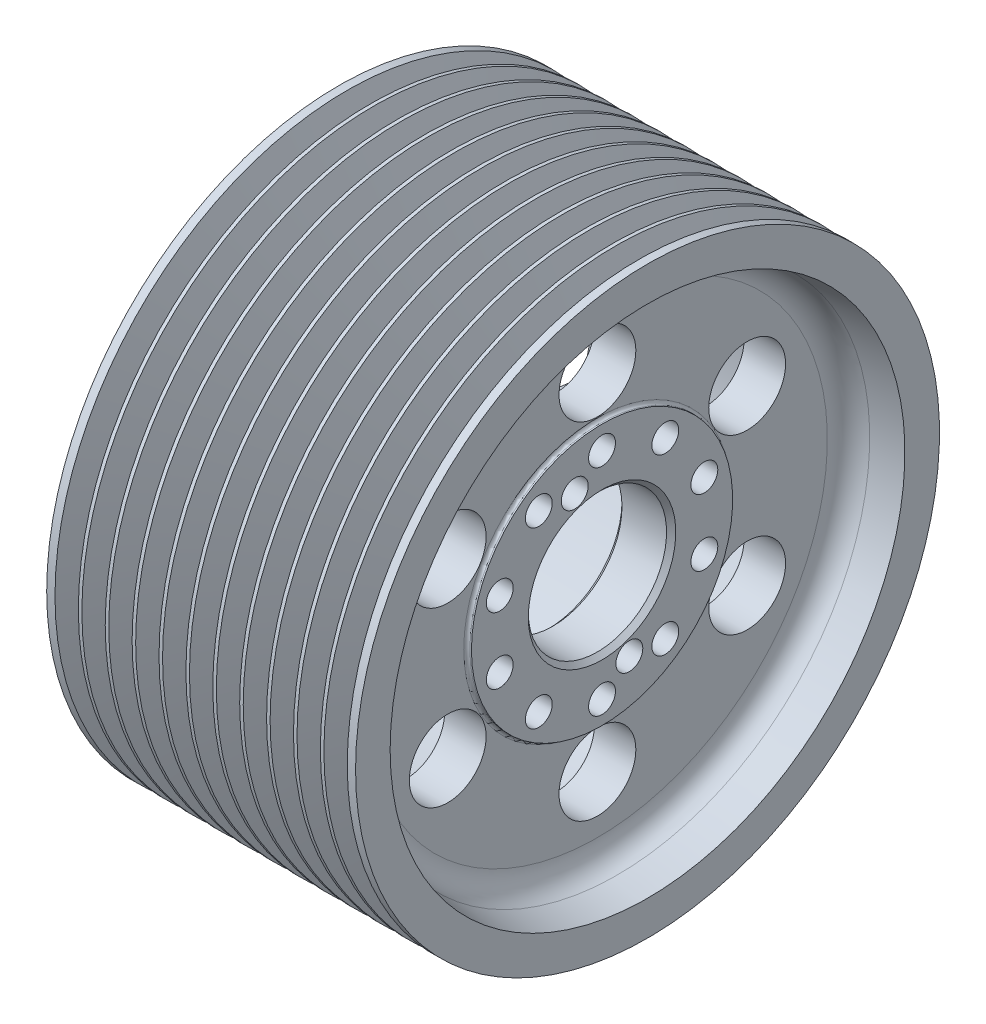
ISO-10303-21;
HEADER;
FILE_DESCRIPTION(('STEP AP214'),'2;1');
FILE_NAME('part.step','',(''),(''),'','','');
FILE_SCHEMA(('AUTOMOTIVE_DESIGN { 1 0 10303 214 1 1 1 1 }'));
ENDSEC;
DATA;
#1=APPLICATION_CONTEXT('core data for automotive mechanical design processes');
#2=APPLICATION_PROTOCOL_DEFINITION('international standard','automotive_design',2000,#1);
#3=PRODUCT_CONTEXT('',#1,'mechanical');
#4=PRODUCT('Part','Part','',(#3));
#5=PRODUCT_RELATED_PRODUCT_CATEGORY('part','',(#4));
#6=PRODUCT_DEFINITION_FORMATION('','',#4);
#7=PRODUCT_DEFINITION_CONTEXT('part definition',#1,'design');
#8=PRODUCT_DEFINITION('design','',#6,#7);
#9=PRODUCT_DEFINITION_SHAPE('','',#8);
#10=(LENGTH_UNIT() NAMED_UNIT(*) SI_UNIT(.MILLI.,.METRE.));
#11=(NAMED_UNIT(*) PLANE_ANGLE_UNIT() SI_UNIT($,.RADIAN.));
#12=(NAMED_UNIT(*) SI_UNIT($,.STERADIAN.) SOLID_ANGLE_UNIT());
#13=UNCERTAINTY_MEASURE_WITH_UNIT(LENGTH_MEASURE(1.E-05),#10,'distance_accuracy_value','');
#14=(GEOMETRIC_REPRESENTATION_CONTEXT(3) GLOBAL_UNCERTAINTY_ASSIGNED_CONTEXT((#13)) GLOBAL_UNIT_ASSIGNED_CONTEXT((#10,
#11,#12)) REPRESENTATION_CONTEXT('',''));
#15=CARTESIAN_POINT('',(0.,0.,0.));
#16=DIRECTION('',(0.,0.,1.));
#17=DIRECTION('',(1.,0.,0.));
#18=AXIS2_PLACEMENT_3D('',#15,#16,#17);
#19=CARTESIAN_POINT('',(171.4,85.,0.));
#20=DIRECTION('',(-1.,0.,0.));
#21=DIRECTION('',(0.,0.,1.));
#22=AXIS2_PLACEMENT_3D('',#19,#20,#21);
#23=PLANE('',#22);
#24=CARTESIAN_POINT('',(171.4,0.,0.));
#25=DIRECTION('',(-1.,0.,0.));
#26=DIRECTION('',(0.,0.,1.));
#27=AXIS2_PLACEMENT_3D('',#24,#25,#26);
#28=CIRCLE('',#27,48.0000000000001);
#29=CARTESIAN_POINT('',(171.4,0.,48.0000000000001));
#30=VERTEX_POINT('',#29);
#31=EDGE_CURVE('E41',#30,#30,#28,.T.);
#32=ORIENTED_EDGE('',*,*,#31,.T.);
#33=EDGE_LOOP('',(#32));
#34=FACE_BOUND('',#33,.T.);
#35=CARTESIAN_POINT('',(171.4,21.6311896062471,66.5739561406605));
#36=DIRECTION('',(1.,0.,0.));
#37=DIRECTION('',(0.,0.,-1.));
#38=AXIS2_PLACEMENT_3D('',#35,#36,#37);
#39=CIRCLE('',#38,8.74999999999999);
#40=CARTESIAN_POINT('',(171.4,21.6311896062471,57.8239561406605));
#41=VERTEX_POINT('',#40);
#42=EDGE_CURVE('E294',#41,#41,#39,.T.);
#43=ORIENTED_EDGE('',*,*,#42,.F.);
#44=EDGE_LOOP('',(#43));
#45=FACE_BOUND('',#44,.T.);
#46=CARTESIAN_POINT('',(171.4,-21.6311896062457,66.573956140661));
#47=DIRECTION('',(1.,0.,0.));
#48=DIRECTION('',(0.,0.,-1.));
#49=AXIS2_PLACEMENT_3D('',#46,#47,#48);
#50=CIRCLE('',#49,8.74999999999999);
#51=CARTESIAN_POINT('',(171.4,-21.6311896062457,57.823956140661));
#52=VERTEX_POINT('',#51);
#53=EDGE_CURVE('E288',#52,#52,#50,.T.);
#54=ORIENTED_EDGE('',*,*,#53,.F.);
#55=EDGE_LOOP('',(#54));
#56=FACE_BOUND('',#55,.T.);
#57=CARTESIAN_POINT('',(171.4,-56.631189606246,41.1449676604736));
#58=DIRECTION('',(1.,0.,0.));
#59=DIRECTION('',(0.,0.,-1.));
#60=AXIS2_PLACEMENT_3D('',#57,#58,#59);
#61=CIRCLE('',#60,8.74999999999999);
#62=CARTESIAN_POINT('',(171.4,-56.631189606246,32.3949676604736));
#63=VERTEX_POINT('',#62);
#64=EDGE_CURVE('E282',#63,#63,#61,.T.);
#65=ORIENTED_EDGE('',*,*,#64,.F.);
#66=EDGE_LOOP('',(#65));
#67=FACE_BOUND('',#66,.T.);
#68=CARTESIAN_POINT('',(171.4,-70.,4.88807387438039E-13));
#69=DIRECTION('',(1.,0.,0.));
#70=DIRECTION('',(0.,0.,-1.));
#71=AXIS2_PLACEMENT_3D('',#68,#69,#70);
#72=CIRCLE('',#71,8.74999999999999);
#73=CARTESIAN_POINT('',(171.4,-70.,-8.7499999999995));
#74=VERTEX_POINT('',#73);
#75=EDGE_CURVE('E276',#74,#74,#72,.T.);
#76=ORIENTED_EDGE('',*,*,#75,.F.);
#77=EDGE_LOOP('',(#76));
#78=FACE_BOUND('',#77,.T.);
#79=CARTESIAN_POINT('',(171.4,-56.6311896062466,-41.1449676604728));
#80=DIRECTION('',(1.,0.,0.));
#81=DIRECTION('',(0.,0.,-1.));
#82=AXIS2_PLACEMENT_3D('',#79,#80,#81);
#83=CIRCLE('',#82,8.74999999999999);
#84=CARTESIAN_POINT('',(171.4,-56.6311896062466,-49.8949676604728));
#85=VERTEX_POINT('',#84);
#86=EDGE_CURVE('E270',#85,#85,#83,.T.);
#87=ORIENTED_EDGE('',*,*,#86,.F.);
#88=EDGE_LOOP('',(#87));
#89=FACE_BOUND('',#88,.T.);
#90=CARTESIAN_POINT('',(171.4,-21.6311896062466,-66.5739561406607));
#91=DIRECTION('',(1.,0.,0.));
#92=DIRECTION('',(0.,0.,-1.));
#93=AXIS2_PLACEMENT_3D('',#90,#91,#92);
#94=CIRCLE('',#93,8.74999999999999);
#95=CARTESIAN_POINT('',(171.4,-21.6311896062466,-75.3239561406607));
#96=VERTEX_POINT('',#95);
#97=EDGE_CURVE('E264',#96,#96,#94,.T.);
#98=ORIENTED_EDGE('',*,*,#97,.F.);
#99=EDGE_LOOP('',(#98));
#100=FACE_BOUND('',#99,.T.);
#101=CARTESIAN_POINT('',(171.4,21.6311896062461,-66.5739561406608));
#102=DIRECTION('',(1.,0.,0.));
#103=DIRECTION('',(0.,0.,-1.));
#104=AXIS2_PLACEMENT_3D('',#101,#102,#103);
#105=CIRCLE('',#104,8.74999999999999);
#106=CARTESIAN_POINT('',(171.4,21.6311896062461,-75.3239561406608));
#107=VERTEX_POINT('',#106);
#108=EDGE_CURVE('E258',#107,#107,#105,.T.);
#109=ORIENTED_EDGE('',*,*,#108,.F.);
#110=EDGE_LOOP('',(#109));
#111=FACE_BOUND('',#110,.T.);
#112=CARTESIAN_POINT('',(171.4,56.6311896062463,-41.1449676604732));
#113=DIRECTION('',(1.,0.,0.));
#114=DIRECTION('',(0.,0.,-1.));
#115=AXIS2_PLACEMENT_3D('',#112,#113,#114);
#116=CIRCLE('',#115,8.74999999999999);
#117=CARTESIAN_POINT('',(171.4,56.6311896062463,-49.8949676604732));
#118=VERTEX_POINT('',#117);
#119=EDGE_CURVE('E252',#118,#118,#116,.T.);
#120=ORIENTED_EDGE('',*,*,#119,.F.);
#121=EDGE_LOOP('',(#120));
#122=FACE_BOUND('',#121,.T.);
#123=CARTESIAN_POINT('',(171.4,70.,0.));
#124=DIRECTION('',(1.,0.,0.));
#125=DIRECTION('',(0.,0.,-1.));
#126=AXIS2_PLACEMENT_3D('',#123,#124,#125);
#127=CIRCLE('',#126,8.74999999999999);
#128=CARTESIAN_POINT('',(171.4,70.,-8.74999999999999));
#129=VERTEX_POINT('',#128);
#130=EDGE_CURVE('E246',#129,#129,#127,.T.);
#131=ORIENTED_EDGE('',*,*,#130,.F.);
#132=EDGE_LOOP('',(#131));
#133=FACE_BOUND('',#132,.T.);
#134=CARTESIAN_POINT('',(171.4,0.,0.));
#135=DIRECTION('',(-1.,0.,0.));
#136=DIRECTION('',(0.,0.,1.));
#137=AXIS2_PLACEMENT_3D('',#134,#135,#136);
#138=CIRCLE('',#137,85.);
#139=CARTESIAN_POINT('',(171.4,0.,85.));
#140=VERTEX_POINT('',#139);
#141=EDGE_CURVE('E84',#140,#140,#138,.T.);
#142=ORIENTED_EDGE('',*,*,#141,.F.);
#143=EDGE_LOOP('',(#142));
#144=FACE_BOUND('',#143,.T.);
#145=CARTESIAN_POINT('',(171.4,56.6311896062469,41.1449676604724));
#146=DIRECTION('',(1.,0.,0.));
#147=DIRECTION('',(0.,0.,-1.));
#148=AXIS2_PLACEMENT_3D('',#145,#146,#147);
#149=CIRCLE('',#148,8.74999999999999);
#150=CARTESIAN_POINT('',(171.4,56.6311896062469,32.3949676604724));
#151=VERTEX_POINT('',#150);
#152=EDGE_CURVE('E300',#151,#151,#149,.T.);
#153=ORIENTED_EDGE('',*,*,#152,.F.);
#154=EDGE_LOOP('',(#153));
#155=FACE_BOUND('',#154,.T.);
#156=CARTESIAN_POINT('',(171.4,54.6857496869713,17.7684771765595));
#157=DIRECTION('',(1.,0.,0.));
#158=DIRECTION('',(0.,0.,-1.));
#159=AXIS2_PLACEMENT_3D('',#156,#157,#158);
#160=CIRCLE('',#159,8.74999999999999);
#161=CARTESIAN_POINT('',(171.4,54.6857496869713,9.01847717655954));
#162=VERTEX_POINT('',#161);
#163=EDGE_CURVE('E343',#162,#162,#160,.T.);
#164=ORIENTED_EDGE('',*,*,#163,.F.);
#165=EDGE_LOOP('',(#164));
#166=FACE_BOUND('',#165,.T.);
#167=CARTESIAN_POINT('',(171.4,-54.6857496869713,-17.7684771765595));
#168=DIRECTION('',(1.,0.,0.));
#169=DIRECTION('',(0.,0.,-1.));
#170=AXIS2_PLACEMENT_3D('',#167,#168,#169);
#171=CIRCLE('',#170,8.74999999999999);
#172=CARTESIAN_POINT('',(171.4,-54.6857496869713,-26.5184771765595));
#173=VERTEX_POINT('',#172);
#174=EDGE_CURVE('E350',#173,#173,#171,.T.);
#175=ORIENTED_EDGE('',*,*,#174,.F.);
#176=EDGE_LOOP('',(#175));
#177=FACE_BOUND('',#176,.T.);
#178=ADVANCED_FACE('F30',(#34,#45,#56,#67,#78,#89,#100,#111,#122,#133,#144,#155,#166,#177),#23,.F.);
#179=CARTESIAN_POINT('',(0.,0.,0.));
#180=DIRECTION('',(-1.,0.,0.));
#181=DIRECTION('',(0.,0.,1.));
#182=AXIS2_PLACEMENT_3D('',#179,#180,#181);
#183=CYLINDRICAL_SURFACE('',#182,190.);
#184=CARTESIAN_POINT('',(22.9,0.,0.));
#185=DIRECTION('',(-1.,0.,0.));
#186=DIRECTION('',(0.,0.,1.));
#187=AXIS2_PLACEMENT_3D('',#184,#185,#186);
#188=CIRCLE('',#187,190.);
#189=CARTESIAN_POINT('',(22.9,0.,190.));
#190=VERTEX_POINT('',#189);
#191=EDGE_CURVE('E222',#190,#190,#188,.T.);
#192=ORIENTED_EDGE('',*,*,#191,.T.);
#193=EDGE_LOOP('',(#192));
#194=FACE_BOUND('',#193,.T.);
#195=CARTESIAN_POINT('',(20.6,0.,0.));
#196=DIRECTION('',(-1.,0.,0.));
#197=DIRECTION('',(0.,0.,1.));
#198=AXIS2_PLACEMENT_3D('',#195,#196,#197);
#199=CIRCLE('',#198,190.);
#200=CARTESIAN_POINT('',(20.6,0.,190.));
#201=VERTEX_POINT('',#200);
#202=EDGE_CURVE('E231',#201,#201,#199,.T.);
#203=ORIENTED_EDGE('',*,*,#202,.F.);
#204=EDGE_LOOP('',(#203));
#205=FACE_BOUND('',#204,.T.);
#206=ADVANCED_FACE('F357',(#194,#205),#183,.T.);
#207=CARTESIAN_POINT('',(0.,0.,0.));
#208=DIRECTION('',(-1.,0.,0.));
#209=DIRECTION('',(0.,0.,1.));
#210=AXIS2_PLACEMENT_3D('',#207,#208,#209);
#211=CIRCLE('',#210,190.);
#212=CARTESIAN_POINT('',(0.,0.,190.));
#213=VERTEX_POINT('',#212);
#214=EDGE_CURVE('E105',#213,#213,#211,.T.);
#215=ORIENTED_EDGE('',*,*,#214,.F.);
#216=EDGE_LOOP('',(#215));
#217=FACE_BOUND('',#216,.T.);
#218=CARTESIAN_POINT('',(5.39999999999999,0.,0.));
#219=DIRECTION('',(-1.,0.,0.));
#220=DIRECTION('',(0.,0.,1.));
#221=AXIS2_PLACEMENT_3D('',#218,#219,#220);
#222=CIRCLE('',#221,190.);
#223=CARTESIAN_POINT('',(5.39999999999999,0.,190.));
#224=VERTEX_POINT('',#223);
#225=EDGE_CURVE('E234',#224,#224,#222,.T.);
#226=ORIENTED_EDGE('',*,*,#225,.T.);
#227=EDGE_LOOP('',(#226));
#228=FACE_BOUND('',#227,.T.);
#229=ADVANCED_FACE('F363',(#217,#228),#183,.T.);
#230=CARTESIAN_POINT('',(40.4,0.,0.));
#231=DIRECTION('',(-1.,0.,0.));
#232=DIRECTION('',(0.,0.,1.));
#233=AXIS2_PLACEMENT_3D('',#230,#231,#232);
#234=CIRCLE('',#233,190.);
#235=CARTESIAN_POINT('',(40.4,0.,190.));
#236=VERTEX_POINT('',#235);
#237=EDGE_CURVE('E210',#236,#236,#234,.T.);
#238=ORIENTED_EDGE('',*,*,#237,.T.);
#239=EDGE_LOOP('',(#238));
#240=FACE_BOUND('',#239,.T.);
#241=CARTESIAN_POINT('',(38.1,0.,0.));
#242=DIRECTION('',(-1.,0.,0.));
#243=DIRECTION('',(0.,0.,1.));
#244=AXIS2_PLACEMENT_3D('',#241,#242,#243);
#245=CIRCLE('',#244,190.);
#246=CARTESIAN_POINT('',(38.1,0.,190.));
#247=VERTEX_POINT('',#246);
#248=EDGE_CURVE('E219',#247,#247,#245,.T.);
#249=ORIENTED_EDGE('',*,*,#248,.F.);
#250=EDGE_LOOP('',(#249));
#251=FACE_BOUND('',#250,.T.);
#252=ADVANCED_FACE('F1220',(#240,#251),#183,.T.);
#253=CARTESIAN_POINT('',(57.9,0.,0.));
#254=DIRECTION('',(-1.,0.,0.));
#255=DIRECTION('',(0.,0.,1.));
#256=AXIS2_PLACEMENT_3D('',#253,#254,#255);
#257=CIRCLE('',#256,190.);
#258=CARTESIAN_POINT('',(57.9,0.,190.));
#259=VERTEX_POINT('',#258);
#260=EDGE_CURVE('E198',#259,#259,#257,.T.);
#261=ORIENTED_EDGE('',*,*,#260,.T.);
#262=EDGE_LOOP('',(#261));
#263=FACE_BOUND('',#262,.T.);
#264=CARTESIAN_POINT('',(55.6,0.,0.));
#265=DIRECTION('',(-1.,0.,0.));
#266=DIRECTION('',(0.,0.,1.));
#267=AXIS2_PLACEMENT_3D('',#264,#265,#266);
#268=CIRCLE('',#267,190.);
#269=CARTESIAN_POINT('',(55.6,0.,190.));
#270=VERTEX_POINT('',#269);
#271=EDGE_CURVE('E207',#270,#270,#268,.T.);
#272=ORIENTED_EDGE('',*,*,#271,.F.);
#273=EDGE_LOOP('',(#272));
#274=FACE_BOUND('',#273,.T.);
#275=ADVANCED_FACE('F1211',(#263,#274),#183,.T.);
#276=CARTESIAN_POINT('',(75.4,0.,0.));
#277=DIRECTION('',(-1.,0.,0.));
#278=DIRECTION('',(0.,0.,1.));
#279=AXIS2_PLACEMENT_3D('',#276,#277,#278);
#280=CIRCLE('',#279,190.);
#281=CARTESIAN_POINT('',(75.4,0.,190.));
#282=VERTEX_POINT('',#281);
#283=EDGE_CURVE('E186',#282,#282,#280,.T.);
#284=ORIENTED_EDGE('',*,*,#283,.T.);
#285=EDGE_LOOP('',(#284));
#286=FACE_BOUND('',#285,.T.);
#287=CARTESIAN_POINT('',(73.1,0.,0.));
#288=DIRECTION('',(-1.,0.,0.));
#289=DIRECTION('',(0.,0.,1.));
#290=AXIS2_PLACEMENT_3D('',#287,#288,#289);
#291=CIRCLE('',#290,190.);
#292=CARTESIAN_POINT('',(73.1,0.,190.));
#293=VERTEX_POINT('',#292);
#294=EDGE_CURVE('E195',#293,#293,#291,.T.);
#295=ORIENTED_EDGE('',*,*,#294,.F.);
#296=EDGE_LOOP('',(#295));
#297=FACE_BOUND('',#296,.T.);
#298=ADVANCED_FACE('F1202',(#286,#297),#183,.T.);
#299=CARTESIAN_POINT('',(92.9,0.,0.));
#300=DIRECTION('',(-1.,0.,0.));
#301=DIRECTION('',(0.,0.,1.));
#302=AXIS2_PLACEMENT_3D('',#299,#300,#301);
#303=CIRCLE('',#302,190.);
#304=CARTESIAN_POINT('',(92.9,0.,190.));
#305=VERTEX_POINT('',#304);
#306=EDGE_CURVE('E174',#305,#305,#303,.T.);
#307=ORIENTED_EDGE('',*,*,#306,.T.);
#308=EDGE_LOOP('',(#307));
#309=FACE_BOUND('',#308,.T.);
#310=CARTESIAN_POINT('',(90.6,0.,0.));
#311=DIRECTION('',(-1.,0.,0.));
#312=DIRECTION('',(0.,0.,1.));
#313=AXIS2_PLACEMENT_3D('',#310,#311,#312);
#314=CIRCLE('',#313,190.);
#315=CARTESIAN_POINT('',(90.6,0.,190.));
#316=VERTEX_POINT('',#315);
#317=EDGE_CURVE('E183',#316,#316,#314,.T.);
#318=ORIENTED_EDGE('',*,*,#317,.F.);
#319=EDGE_LOOP('',(#318));
#320=FACE_BOUND('',#319,.T.);
#321=ADVANCED_FACE('F1193',(#309,#320),#183,.T.);
#322=CARTESIAN_POINT('',(110.4,0.,0.));
#323=DIRECTION('',(-1.,0.,0.));
#324=DIRECTION('',(0.,0.,1.));
#325=AXIS2_PLACEMENT_3D('',#322,#323,#324);
#326=CIRCLE('',#325,190.);
#327=CARTESIAN_POINT('',(110.4,0.,190.));
#328=VERTEX_POINT('',#327);
#329=EDGE_CURVE('E162',#328,#328,#326,.T.);
#330=ORIENTED_EDGE('',*,*,#329,.T.);
#331=EDGE_LOOP('',(#330));
#332=FACE_BOUND('',#331,.T.);
#333=CARTESIAN_POINT('',(108.1,0.,0.));
#334=DIRECTION('',(-1.,0.,0.));
#335=DIRECTION('',(0.,0.,1.));
#336=AXIS2_PLACEMENT_3D('',#333,#334,#335);
#337=CIRCLE('',#336,190.);
#338=CARTESIAN_POINT('',(108.1,0.,190.));
#339=VERTEX_POINT('',#338);
#340=EDGE_CURVE('E171',#339,#339,#337,.T.);
#341=ORIENTED_EDGE('',*,*,#340,.F.);
#342=EDGE_LOOP('',(#341));
#343=FACE_BOUND('',#342,.T.);
#344=ADVANCED_FACE('F1184',(#332,#343),#183,.T.);
#345=CARTESIAN_POINT('',(127.9,0.,0.));
#346=DIRECTION('',(-1.,0.,0.));
#347=DIRECTION('',(0.,0.,1.));
#348=AXIS2_PLACEMENT_3D('',#345,#346,#347);
#349=CIRCLE('',#348,190.);
#350=CARTESIAN_POINT('',(127.9,0.,190.));
#351=VERTEX_POINT('',#350);
#352=EDGE_CURVE('E150',#351,#351,#349,.T.);
#353=ORIENTED_EDGE('',*,*,#352,.T.);
#354=EDGE_LOOP('',(#353));
#355=FACE_BOUND('',#354,.T.);
#356=CARTESIAN_POINT('',(125.6,0.,0.));
#357=DIRECTION('',(-1.,0.,0.));
#358=DIRECTION('',(0.,0.,1.));
#359=AXIS2_PLACEMENT_3D('',#356,#357,#358);
#360=CIRCLE('',#359,190.);
#361=CARTESIAN_POINT('',(125.6,0.,190.));
#362=VERTEX_POINT('',#361);
#363=EDGE_CURVE('E159',#362,#362,#360,.T.);
#364=ORIENTED_EDGE('',*,*,#363,.F.);
#365=EDGE_LOOP('',(#364));
#366=FACE_BOUND('',#365,.T.);
#367=ADVANCED_FACE('F1175',(#355,#366),#183,.T.);
#368=CARTESIAN_POINT('',(145.4,0.,0.));
#369=DIRECTION('',(-1.,0.,0.));
#370=DIRECTION('',(0.,0.,1.));
#371=AXIS2_PLACEMENT_3D('',#368,#369,#370);
#372=CIRCLE('',#371,190.);
#373=CARTESIAN_POINT('',(145.4,0.,190.));
#374=VERTEX_POINT('',#373);
#375=EDGE_CURVE('E138',#374,#374,#372,.T.);
#376=ORIENTED_EDGE('',*,*,#375,.T.);
#377=EDGE_LOOP('',(#376));
#378=FACE_BOUND('',#377,.T.);
#379=CARTESIAN_POINT('',(143.1,0.,0.));
#380=DIRECTION('',(-1.,0.,0.));
#381=DIRECTION('',(0.,0.,1.));
#382=AXIS2_PLACEMENT_3D('',#379,#380,#381);
#383=CIRCLE('',#382,190.);
#384=CARTESIAN_POINT('',(143.1,0.,190.));
#385=VERTEX_POINT('',#384);
#386=EDGE_CURVE('E147',#385,#385,#383,.T.);
#387=ORIENTED_EDGE('',*,*,#386,.F.);
#388=EDGE_LOOP('',(#387));
#389=FACE_BOUND('',#388,.T.);
#390=ADVANCED_FACE('F1166',(#378,#389),#183,.T.);
#391=CARTESIAN_POINT('',(162.9,0.,0.));
#392=DIRECTION('',(-1.,0.,0.));
#393=DIRECTION('',(0.,0.,1.));
#394=AXIS2_PLACEMENT_3D('',#391,#392,#393);
#395=CIRCLE('',#394,190.);
#396=CARTESIAN_POINT('',(162.9,0.,190.));
#397=VERTEX_POINT('',#396);
#398=EDGE_CURVE('E126',#397,#397,#395,.T.);
#399=ORIENTED_EDGE('',*,*,#398,.T.);
#400=EDGE_LOOP('',(#399));
#401=FACE_BOUND('',#400,.T.);
#402=CARTESIAN_POINT('',(160.6,0.,0.));
#403=DIRECTION('',(-1.,0.,0.));
#404=DIRECTION('',(0.,0.,1.));
#405=AXIS2_PLACEMENT_3D('',#402,#403,#404);
#406=CIRCLE('',#405,190.);
#407=CARTESIAN_POINT('',(160.6,0.,190.));
#408=VERTEX_POINT('',#407);
#409=EDGE_CURVE('E135',#408,#408,#406,.T.);
#410=ORIENTED_EDGE('',*,*,#409,.F.);
#411=EDGE_LOOP('',(#410));
#412=FACE_BOUND('',#411,.T.);
#413=ADVANCED_FACE('F1156',(#401,#412),#183,.T.);
#414=CARTESIAN_POINT('',(180.4,0.,0.));
#415=DIRECTION('',(-1.,0.,0.));
#416=DIRECTION('',(0.,0.,1.));
#417=AXIS2_PLACEMENT_3D('',#414,#415,#416);
#418=CIRCLE('',#417,190.);
#419=CARTESIAN_POINT('',(180.4,0.,190.));
#420=VERTEX_POINT('',#419);
#421=EDGE_CURVE('E114',#420,#420,#418,.T.);
#422=ORIENTED_EDGE('',*,*,#421,.T.);
#423=EDGE_LOOP('',(#422));
#424=FACE_BOUND('',#423,.T.);
#425=CARTESIAN_POINT('',(178.1,0.,0.));
#426=DIRECTION('',(-1.,0.,0.));
#427=DIRECTION('',(0.,0.,1.));
#428=AXIS2_PLACEMENT_3D('',#425,#426,#427);
#429=CIRCLE('',#428,190.);
#430=CARTESIAN_POINT('',(178.1,0.,190.));
#431=VERTEX_POINT('',#430);
#432=EDGE_CURVE('E123',#431,#431,#429,.T.);
#433=ORIENTED_EDGE('',*,*,#432,.F.);
#434=EDGE_LOOP('',(#433));
#435=FACE_BOUND('',#434,.T.);
#436=ADVANCED_FACE('F634',(#424,#435),#183,.T.);
#437=CARTESIAN_POINT('',(201.,0.,0.));
#438=DIRECTION('',(-1.,0.,0.));
#439=DIRECTION('',(0.,0.,1.));
#440=AXIS2_PLACEMENT_3D('',#437,#438,#439);
#441=CIRCLE('',#440,190.);
#442=CARTESIAN_POINT('',(201.,0.,190.));
#443=VERTEX_POINT('',#442);
#444=EDGE_CURVE('E102',#443,#443,#441,.T.);
#445=ORIENTED_EDGE('',*,*,#444,.T.);
#446=EDGE_LOOP('',(#445));
#447=FACE_BOUND('',#446,.T.);
#448=CARTESIAN_POINT('',(195.6,0.,0.));
#449=DIRECTION('',(-1.,0.,0.));
#450=DIRECTION('',(0.,0.,1.));
#451=AXIS2_PLACEMENT_3D('',#448,#449,#450);
#452=CIRCLE('',#451,190.);
#453=CARTESIAN_POINT('',(195.6,0.,190.));
#454=VERTEX_POINT('',#453);
#455=EDGE_CURVE('E111',#454,#454,#452,.T.);
#456=ORIENTED_EDGE('',*,*,#455,.F.);
#457=EDGE_LOOP('',(#456));
#458=FACE_BOUND('',#457,.T.);
#459=ADVANCED_FACE('F366',(#447,#458),#183,.T.);
#460=CARTESIAN_POINT('',(59.9999999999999,167.5,0.));
#461=DIRECTION('',(1.,0.,0.));
#462=DIRECTION('',(0.,0.,-1.));
#463=AXIS2_PLACEMENT_3D('',#460,#461,#462);
#464=PLANE('',#463);
#465=CARTESIAN_POINT('',(59.9999999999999,0.,0.));
#466=DIRECTION('',(1.,0.,0.));
#467=DIRECTION('',(0.,0.,-1.));
#468=AXIS2_PLACEMENT_3D('',#465,#466,#467);
#469=CIRCLE('',#468,166.5);
#470=CARTESIAN_POINT('',(59.9999999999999,0.,-166.5));
#471=VERTEX_POINT('',#470);
#472=EDGE_CURVE('E37',#471,#471,#469,.F.);
#473=ORIENTED_EDGE('',*,*,#472,.T.);
#474=EDGE_LOOP('',(#473));
#475=FACE_BOUND('',#474,.T.);
#476=CARTESIAN_POINT('',(59.9999999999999,0.,0.));
#477=DIRECTION('',(-1.,0.,0.));
#478=DIRECTION('',(0.,0.,1.));
#479=AXIS2_PLACEMENT_3D('',#476,#477,#478);
#480=CIRCLE('',#479,165.);
#481=CARTESIAN_POINT('',(59.9999999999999,0.,165.));
#482=VERTEX_POINT('',#481);
#483=EDGE_CURVE('E66',#482,#482,#480,.T.);
#484=ORIENTED_EDGE('',*,*,#483,.F.);
#485=EDGE_LOOP('',(#484));
#486=FACE_BOUND('',#485,.T.);
#487=ADVANCED_FACE('F399',(#475,#486),#464,.F.);
#488=CARTESIAN_POINT('',(59.9999999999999,0.,0.));
#489=DIRECTION('',(-1.,0.,0.));
#490=DIRECTION('',(0.,0.,1.));
#491=AXIS2_PLACEMENT_3D('',#488,#489,#490);
#492=CONICAL_SURFACE('',#491,165.,0.03070287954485);
#493=CARTESIAN_POINT('',(126.860470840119,0.,0.));
#494=DIRECTION('',(-1.,0.,0.));
#495=DIRECTION('',(0.,0.,1.));
#496=AXIS2_PLACEMENT_3D('',#493,#494,#495);
#497=CIRCLE('',#496,162.946545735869);
#498=CARTESIAN_POINT('',(126.860470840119,0.,162.946545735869));
#499=VERTEX_POINT('',#498);
#500=EDGE_CURVE('E69',#499,#499,#497,.T.);
#501=ORIENTED_EDGE('',*,*,#500,.F.);
#502=EDGE_LOOP('',(#501));
#503=FACE_BOUND('',#502,.T.);
#504=ORIENTED_EDGE('',*,*,#483,.T.);
#505=EDGE_LOOP('',(#504));
#506=FACE_BOUND('',#505,.T.);
#507=ADVANCED_FACE('F395',(#503,#506),#492,.F.);
#508=CARTESIAN_POINT('',(126.4,0.,0.));
#509=DIRECTION('',(-1.,0.,0.));
#510=DIRECTION('',(0.,0.,1.));
#511=AXIS2_PLACEMENT_3D('',#508,#509,#510);
#512=TOROIDAL_SURFACE('',#511,147.953615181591,15.);
#513=CARTESIAN_POINT('',(141.4,0.,0.));
#514=DIRECTION('',(-1.,0.,0.));
#515=DIRECTION('',(0.,0.,1.));
#516=AXIS2_PLACEMENT_3D('',#513,#514,#515);
#517=CIRCLE('',#516,147.953615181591);
#518=CARTESIAN_POINT('',(141.4,0.,147.953615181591));
#519=VERTEX_POINT('',#518);
#520=EDGE_CURVE('E72',#519,#519,#517,.T.);
#521=ORIENTED_EDGE('',*,*,#520,.F.);
#522=EDGE_LOOP('',(#521));
#523=FACE_BOUND('',#522,.T.);
#524=ORIENTED_EDGE('',*,*,#500,.T.);
#525=EDGE_LOOP('',(#524));
#526=FACE_BOUND('',#525,.T.);
#527=ADVANCED_FACE('F391',(#523,#526),#512,.F.);
#528=CARTESIAN_POINT('',(141.4,87.,0.));
#529=DIRECTION('',(1.,0.,0.));
#530=DIRECTION('',(0.,0.,-1.));
#531=AXIS2_PLACEMENT_3D('',#528,#529,#530);
#532=PLANE('',#531);
#533=CARTESIAN_POINT('',(141.4,56.2500000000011,97.4278579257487));
#534=DIRECTION('',(1.,0.,0.));
#535=DIRECTION('',(0.,0.,-1.));
#536=AXIS2_PLACEMENT_3D('',#533,#534,#535);
#537=CIRCLE('',#536,25.);
#538=CARTESIAN_POINT('',(141.4,56.2500000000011,72.4278579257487));
#539=VERTEX_POINT('',#538);
#540=EDGE_CURVE('E333',#539,#539,#537,.F.);
#541=ORIENTED_EDGE('',*,*,#540,.F.);
#542=EDGE_LOOP('',(#541));
#543=FACE_BOUND('',#542,.T.);
#544=CARTESIAN_POINT('',(141.4,-56.2499999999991,97.4278579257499));
#545=DIRECTION('',(1.,0.,0.));
#546=DIRECTION('',(0.,0.,-1.));
#547=AXIS2_PLACEMENT_3D('',#544,#545,#546);
#548=CIRCLE('',#547,25.);
#549=CARTESIAN_POINT('',(141.4,-56.2499999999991,72.4278579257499));
#550=VERTEX_POINT('',#549);
#551=EDGE_CURVE('E327',#550,#550,#548,.F.);
#552=ORIENTED_EDGE('',*,*,#551,.F.);
#553=EDGE_LOOP('',(#552));
#554=FACE_BOUND('',#553,.T.);
#555=CARTESIAN_POINT('',(141.4,-112.5,0.));
#556=DIRECTION('',(1.,0.,0.));
#557=DIRECTION('',(0.,0.,-1.));
#558=AXIS2_PLACEMENT_3D('',#555,#556,#557);
#559=CIRCLE('',#558,25.);
#560=CARTESIAN_POINT('',(141.4,-112.5,-25.));
#561=VERTEX_POINT('',#560);
#562=EDGE_CURVE('E321',#561,#561,#559,.F.);
#563=ORIENTED_EDGE('',*,*,#562,.F.);
#564=EDGE_LOOP('',(#563));
#565=FACE_BOUND('',#564,.T.);
#566=CARTESIAN_POINT('',(141.4,-56.2500000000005,-97.4278579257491));
#567=DIRECTION('',(1.,0.,0.));
#568=DIRECTION('',(0.,0.,-1.));
#569=AXIS2_PLACEMENT_3D('',#566,#567,#568);
#570=CIRCLE('',#569,25.);
#571=CARTESIAN_POINT('',(141.4,-56.2500000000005,-122.427857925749));
#572=VERTEX_POINT('',#571);
#573=EDGE_CURVE('E315',#572,#572,#570,.F.);
#574=ORIENTED_EDGE('',*,*,#573,.F.);
#575=EDGE_LOOP('',(#574));
#576=FACE_BOUND('',#575,.T.);
#577=CARTESIAN_POINT('',(141.4,56.2499999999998,-97.4278579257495));
#578=DIRECTION('',(1.,0.,0.));
#579=DIRECTION('',(0.,0.,-1.));
#580=AXIS2_PLACEMENT_3D('',#577,#578,#579);
#581=CIRCLE('',#580,25.);
#582=CARTESIAN_POINT('',(141.4,56.2499999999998,-122.427857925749));
#583=VERTEX_POINT('',#582);
#584=EDGE_CURVE('E309',#583,#583,#581,.F.);
#585=ORIENTED_EDGE('',*,*,#584,.F.);
#586=EDGE_LOOP('',(#585));
#587=FACE_BOUND('',#586,.T.);
#588=CARTESIAN_POINT('',(141.4,112.5,0.));
#589=DIRECTION('',(1.,0.,0.));
#590=DIRECTION('',(0.,0.,-1.));
#591=AXIS2_PLACEMENT_3D('',#588,#589,#590);
#592=CIRCLE('',#591,25.);
#593=CARTESIAN_POINT('',(141.4,112.5,-25.));
#594=VERTEX_POINT('',#593);
#595=EDGE_CURVE('E303',#594,#594,#592,.F.);
#596=ORIENTED_EDGE('',*,*,#595,.F.);
#597=EDGE_LOOP('',(#596));
#598=FACE_BOUND('',#597,.T.);
#599=CARTESIAN_POINT('',(141.4,0.,0.));
#600=DIRECTION('',(-1.,0.,0.));
#601=DIRECTION('',(0.,0.,1.));
#602=AXIS2_PLACEMENT_3D('',#599,#600,#601);
#603=CIRCLE('',#602,87.);
#604=CARTESIAN_POINT('',(141.4,0.,87.));
#605=VERTEX_POINT('',#604);
#606=EDGE_CURVE('E75',#605,#605,#603,.T.);
#607=ORIENTED_EDGE('',*,*,#606,.F.);
#608=EDGE_LOOP('',(#607));
#609=FACE_BOUND('',#608,.T.);
#610=ORIENTED_EDGE('',*,*,#520,.T.);
#611=EDGE_LOOP('',(#610));
#612=FACE_BOUND('',#611,.T.);
#613=ADVANCED_FACE('F387',(#543,#554,#565,#576,#587,#598,#609,#612),#532,.F.);
#614=CARTESIAN_POINT('',(139.4,0.,0.));
#615=DIRECTION('',(-1.,0.,0.));
#616=DIRECTION('',(0.,0.,1.));
#617=AXIS2_PLACEMENT_3D('',#614,#615,#616);
#618=TOROIDAL_SURFACE('',#617,87.,2.);
#619=CARTESIAN_POINT('',(139.4,0.,0.));
#620=DIRECTION('',(-1.,0.,0.));
#621=DIRECTION('',(0.,0.,1.));
#622=AXIS2_PLACEMENT_3D('',#619,#620,#621);
#623=CIRCLE('',#622,85.);
#624=CARTESIAN_POINT('',(139.4,0.,85.));
#625=VERTEX_POINT('',#624);
#626=EDGE_CURVE('E78',#625,#625,#623,.T.);
#627=ORIENTED_EDGE('',*,*,#626,.F.);
#628=EDGE_LOOP('',(#627));
#629=FACE_BOUND('',#628,.T.);
#630=ORIENTED_EDGE('',*,*,#606,.T.);
#631=EDGE_LOOP('',(#630));
#632=FACE_BOUND('',#631,.T.);
#633=ADVANCED_FACE('F383',(#629,#632),#618,.F.);
#634=CARTESIAN_POINT('',(0.,0.,0.));
#635=DIRECTION('',(-1.,0.,0.));
#636=DIRECTION('',(0.,0.,1.));
#637=AXIS2_PLACEMENT_3D('',#634,#635,#636);
#638=CYLINDRICAL_SURFACE('',#637,85.);
#639=CARTESIAN_POINT('',(136.4,0.,0.));
#640=DIRECTION('',(-1.,0.,0.));
#641=DIRECTION('',(0.,0.,1.));
#642=AXIS2_PLACEMENT_3D('',#639,#640,#641);
#643=CIRCLE('',#642,85.);
#644=CARTESIAN_POINT('',(136.4,0.,85.));
#645=VERTEX_POINT('',#644);
#646=EDGE_CURVE('E81',#645,#645,#643,.T.);
#647=ORIENTED_EDGE('',*,*,#646,.F.);
#648=EDGE_LOOP('',(#647));
#649=FACE_BOUND('',#648,.T.);
#650=ORIENTED_EDGE('',*,*,#626,.T.);
#651=EDGE_LOOP('',(#650));
#652=FACE_BOUND('',#651,.T.);
#653=ADVANCED_FACE('F379',(#649,#652),#638,.T.);
#654=CARTESIAN_POINT('',(136.4,45.,0.));
#655=DIRECTION('',(1.,0.,0.));
#656=DIRECTION('',(0.,0.,-1.));
#657=AXIS2_PLACEMENT_3D('',#654,#655,#656);
#658=PLANE('',#657);
#659=CARTESIAN_POINT('',(136.4,-54.6857496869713,-17.7684771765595));
#660=DIRECTION('',(1.,0.,0.));
#661=DIRECTION('',(0.,0.,-1.));
#662=AXIS2_PLACEMENT_3D('',#659,#660,#661);
#663=CIRCLE('',#662,6.99999999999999);
#664=CARTESIAN_POINT('',(136.4,-54.6857496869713,-24.7684771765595));
#665=VERTEX_POINT('',#664);
#666=EDGE_CURVE('E51',#665,#665,#663,.T.);
#667=ORIENTED_EDGE('',*,*,#666,.T.);
#668=EDGE_LOOP('',(#667));
#669=FACE_BOUND('',#668,.T.);
#670=CARTESIAN_POINT('',(136.4,54.6857496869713,17.7684771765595));
#671=DIRECTION('',(1.,0.,0.));
#672=DIRECTION('',(0.,0.,-1.));
#673=AXIS2_PLACEMENT_3D('',#670,#671,#672);
#674=CIRCLE('',#673,6.99999999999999);
#675=CARTESIAN_POINT('',(136.4,54.6857496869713,10.7684771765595));
#676=VERTEX_POINT('',#675);
#677=EDGE_CURVE('E55',#676,#676,#674,.T.);
#678=ORIENTED_EDGE('',*,*,#677,.T.);
#679=EDGE_LOOP('',(#678));
#680=FACE_BOUND('',#679,.T.);
#681=CARTESIAN_POINT('',(136.4,0.,0.));
#682=DIRECTION('',(1.,0.,0.));
#683=DIRECTION('',(0.,0.,-1.));
#684=AXIS2_PLACEMENT_3D('',#681,#682,#683);
#685=CIRCLE('',#684,48.);
#686=CARTESIAN_POINT('',(136.4,0.,-48.));
#687=VERTEX_POINT('',#686);
#688=EDGE_CURVE('E45',#687,#687,#685,.T.);
#689=ORIENTED_EDGE('',*,*,#688,.T.);
#690=EDGE_LOOP('',(#689));
#691=FACE_BOUND('',#690,.T.);
#692=CARTESIAN_POINT('',(136.4,56.6311896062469,41.1449676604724));
#693=DIRECTION('',(1.,0.,0.));
#694=DIRECTION('',(0.,0.,-1.));
#695=AXIS2_PLACEMENT_3D('',#692,#693,#694);
#696=CIRCLE('',#695,8.74999999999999);
#697=CARTESIAN_POINT('',(136.4,56.6311896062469,32.3949676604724));
#698=VERTEX_POINT('',#697);
#699=EDGE_CURVE('E297',#698,#698,#696,.T.);
#700=ORIENTED_EDGE('',*,*,#699,.T.);
#701=EDGE_LOOP('',(#700));
#702=FACE_BOUND('',#701,.T.);
#703=CARTESIAN_POINT('',(136.4,21.6311896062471,66.5739561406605));
#704=DIRECTION('',(1.,0.,0.));
#705=DIRECTION('',(0.,0.,-1.));
#706=AXIS2_PLACEMENT_3D('',#703,#704,#705);
#707=CIRCLE('',#706,8.74999999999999);
#708=CARTESIAN_POINT('',(136.4,21.6311896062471,57.8239561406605));
#709=VERTEX_POINT('',#708);
#710=EDGE_CURVE('E291',#709,#709,#707,.T.);
#711=ORIENTED_EDGE('',*,*,#710,.T.);
#712=EDGE_LOOP('',(#711));
#713=FACE_BOUND('',#712,.T.);
#714=CARTESIAN_POINT('',(136.4,-21.6311896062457,66.573956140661));
#715=DIRECTION('',(1.,0.,0.));
#716=DIRECTION('',(0.,0.,-1.));
#717=AXIS2_PLACEMENT_3D('',#714,#715,#716);
#718=CIRCLE('',#717,8.74999999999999);
#719=CARTESIAN_POINT('',(136.4,-21.6311896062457,57.823956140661));
#720=VERTEX_POINT('',#719);
#721=EDGE_CURVE('E285',#720,#720,#718,.T.);
#722=ORIENTED_EDGE('',*,*,#721,.T.);
#723=EDGE_LOOP('',(#722));
#724=FACE_BOUND('',#723,.T.);
#725=CARTESIAN_POINT('',(136.4,-56.631189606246,41.1449676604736));
#726=DIRECTION('',(1.,0.,0.));
#727=DIRECTION('',(0.,0.,-1.));
#728=AXIS2_PLACEMENT_3D('',#725,#726,#727);
#729=CIRCLE('',#728,8.74999999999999);
#730=CARTESIAN_POINT('',(136.4,-56.631189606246,32.3949676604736));
#731=VERTEX_POINT('',#730);
#732=EDGE_CURVE('E279',#731,#731,#729,.T.);
#733=ORIENTED_EDGE('',*,*,#732,.T.);
#734=EDGE_LOOP('',(#733));
#735=FACE_BOUND('',#734,.T.);
#736=CARTESIAN_POINT('',(136.4,-70.,4.88807387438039E-13));
#737=DIRECTION('',(1.,0.,0.));
#738=DIRECTION('',(0.,0.,-1.));
#739=AXIS2_PLACEMENT_3D('',#736,#737,#738);
#740=CIRCLE('',#739,8.74999999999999);
#741=CARTESIAN_POINT('',(136.4,-70.,-8.7499999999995));
#742=VERTEX_POINT('',#741);
#743=EDGE_CURVE('E273',#742,#742,#740,.T.);
#744=ORIENTED_EDGE('',*,*,#743,.T.);
#745=EDGE_LOOP('',(#744));
#746=FACE_BOUND('',#745,.T.);
#747=CARTESIAN_POINT('',(136.4,-56.6311896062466,-41.1449676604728));
#748=DIRECTION('',(1.,0.,0.));
#749=DIRECTION('',(0.,0.,-1.));
#750=AXIS2_PLACEMENT_3D('',#747,#748,#749);
#751=CIRCLE('',#750,8.74999999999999);
#752=CARTESIAN_POINT('',(136.4,-56.6311896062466,-49.8949676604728));
#753=VERTEX_POINT('',#752);
#754=EDGE_CURVE('E267',#753,#753,#751,.T.);
#755=ORIENTED_EDGE('',*,*,#754,.T.);
#756=EDGE_LOOP('',(#755));
#757=FACE_BOUND('',#756,.T.);
#758=CARTESIAN_POINT('',(136.4,-21.6311896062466,-66.5739561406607));
#759=DIRECTION('',(1.,0.,0.));
#760=DIRECTION('',(0.,0.,-1.));
#761=AXIS2_PLACEMENT_3D('',#758,#759,#760);
#762=CIRCLE('',#761,8.74999999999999);
#763=CARTESIAN_POINT('',(136.4,-21.6311896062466,-75.3239561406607));
#764=VERTEX_POINT('',#763);
#765=EDGE_CURVE('E261',#764,#764,#762,.T.);
#766=ORIENTED_EDGE('',*,*,#765,.T.);
#767=EDGE_LOOP('',(#766));
#768=FACE_BOUND('',#767,.T.);
#769=CARTESIAN_POINT('',(136.4,21.6311896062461,-66.5739561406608));
#770=DIRECTION('',(1.,0.,0.));
#771=DIRECTION('',(0.,0.,-1.));
#772=AXIS2_PLACEMENT_3D('',#769,#770,#771);
#773=CIRCLE('',#772,8.74999999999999);
#774=CARTESIAN_POINT('',(136.4,21.6311896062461,-75.3239561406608));
#775=VERTEX_POINT('',#774);
#776=EDGE_CURVE('E255',#775,#775,#773,.T.);
#777=ORIENTED_EDGE('',*,*,#776,.T.);
#778=EDGE_LOOP('',(#777));
#779=FACE_BOUND('',#778,.T.);
#780=CARTESIAN_POINT('',(136.4,56.6311896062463,-41.1449676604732));
#781=DIRECTION('',(1.,0.,0.));
#782=DIRECTION('',(0.,0.,-1.));
#783=AXIS2_PLACEMENT_3D('',#780,#781,#782);
#784=CIRCLE('',#783,8.74999999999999);
#785=CARTESIAN_POINT('',(136.4,56.6311896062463,-49.8949676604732));
#786=VERTEX_POINT('',#785);
#787=EDGE_CURVE('E249',#786,#786,#784,.T.);
#788=ORIENTED_EDGE('',*,*,#787,.T.);
#789=EDGE_LOOP('',(#788));
#790=FACE_BOUND('',#789,.T.);
#791=CARTESIAN_POINT('',(136.4,70.,0.));
#792=DIRECTION('',(1.,0.,0.));
#793=DIRECTION('',(0.,0.,-1.));
#794=AXIS2_PLACEMENT_3D('',#791,#792,#793);
#795=CIRCLE('',#794,8.74999999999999);
#796=CARTESIAN_POINT('',(136.4,70.,-8.74999999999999));
#797=VERTEX_POINT('',#796);
#798=EDGE_CURVE('E243',#797,#797,#795,.T.);
#799=ORIENTED_EDGE('',*,*,#798,.T.);
#800=EDGE_LOOP('',(#799));
#801=FACE_BOUND('',#800,.T.);
#802=ORIENTED_EDGE('',*,*,#646,.T.);
#803=EDGE_LOOP('',(#802));
#804=FACE_BOUND('',#803,.T.);
#805=ADVANCED_FACE('F375',(#669,#680,#691,#702,#713,#724,#735,#746,#757,#768,#779,#790,#801,
#804),#658,.F.);
#806=CARTESIAN_POINT('',(0.,0.,0.));
#807=DIRECTION('',(-1.,0.,0.));
#808=DIRECTION('',(0.,0.,1.));
#809=AXIS2_PLACEMENT_3D('',#806,#807,#808);
#810=CYLINDRICAL_SURFACE('',#809,45.);
#811=CARTESIAN_POINT('',(139.4,0.,0.));
#812=DIRECTION('',(1.,0.,0.));
#813=DIRECTION('',(0.,0.,-1.));
#814=AXIS2_PLACEMENT_3D('',#811,#812,#813);
#815=CIRCLE('',#814,45.);
#816=CARTESIAN_POINT('',(139.4,0.,-45.));
#817=VERTEX_POINT('',#816);
#818=EDGE_CURVE('E60',#817,#817,#815,.F.);
#819=ORIENTED_EDGE('',*,*,#818,.T.);
#820=EDGE_LOOP('',(#819));
#821=FACE_BOUND('',#820,.T.);
#822=CARTESIAN_POINT('',(168.4,0.,0.));
#823=DIRECTION('',(-1.,0.,0.));
#824=DIRECTION('',(0.,0.,1.));
#825=AXIS2_PLACEMENT_3D('',#822,#823,#824);
#826=CIRCLE('',#825,45.);
#827=CARTESIAN_POINT('',(168.4,0.,45.));
#828=VERTEX_POINT('',#827);
#829=EDGE_CURVE('E63',#828,#828,#826,.F.);
#830=ORIENTED_EDGE('',*,*,#829,.T.);
#831=EDGE_LOOP('',(#830));
#832=FACE_BOUND('',#831,.T.);
#833=ADVANCED_FACE('F372',(#821,#832),#810,.F.);
#834=CARTESIAN_POINT('',(0.,0.,0.));
#835=DIRECTION('',(-1.,0.,0.));
#836=DIRECTION('',(0.,0.,1.));
#837=AXIS2_PLACEMENT_3D('',#834,#835,#836);
#838=CYLINDRICAL_SURFACE('',#837,85.);
#839=CARTESIAN_POINT('',(170.4,0.,0.));
#840=DIRECTION('',(-1.,0.,0.));
#841=DIRECTION('',(0.,0.,1.));
#842=AXIS2_PLACEMENT_3D('',#839,#840,#841);
#843=CIRCLE('',#842,85.);
#844=CARTESIAN_POINT('',(170.4,0.,85.));
#845=VERTEX_POINT('',#844);
#846=EDGE_CURVE('E87',#845,#845,#843,.T.);
#847=ORIENTED_EDGE('',*,*,#846,.F.);
#848=EDGE_LOOP('',(#847));
#849=FACE_BOUND('',#848,.T.);
#850=ORIENTED_EDGE('',*,*,#141,.T.);
#851=EDGE_LOOP('',(#850));
#852=FACE_BOUND('',#851,.T.);
#853=ADVANCED_FACE('F370',(#849,#852),#838,.T.);
#854=CARTESIAN_POINT('',(170.4,0.,0.));
#855=DIRECTION('',(-1.,0.,0.));
#856=DIRECTION('',(0.,0.,1.));
#857=AXIS2_PLACEMENT_3D('',#854,#855,#856);
#858=TOROIDAL_SURFACE('',#857,87.,1.99999999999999);
#859=CARTESIAN_POINT('',(168.4,0.,0.));
#860=DIRECTION('',(-1.,0.,0.));
#861=DIRECTION('',(0.,0.,1.));
#862=AXIS2_PLACEMENT_3D('',#859,#860,#861);
#863=CIRCLE('',#862,87.);
#864=CARTESIAN_POINT('',(168.4,0.,87.));
#865=VERTEX_POINT('',#864);
#866=EDGE_CURVE('E90',#865,#865,#863,.T.);
#867=ORIENTED_EDGE('',*,*,#866,.F.);
#868=EDGE_LOOP('',(#867));
#869=FACE_BOUND('',#868,.T.);
#870=ORIENTED_EDGE('',*,*,#846,.T.);
#871=EDGE_LOOP('',(#870));
#872=FACE_BOUND('',#871,.T.);
#873=ADVANCED_FACE('F649',(#869,#872),#858,.F.);
#874=CARTESIAN_POINT('',(168.4,149.625211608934,0.));
#875=DIRECTION('',(-1.,0.,0.));
#876=DIRECTION('',(0.,0.,1.));
#877=AXIS2_PLACEMENT_3D('',#874,#875,#876);
#878=PLANE('',#877);
#879=CARTESIAN_POINT('',(168.4,56.2500000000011,97.4278579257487));
#880=DIRECTION('',(1.,0.,0.));
#881=DIRECTION('',(0.,0.866025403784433,-0.50000000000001));
#882=AXIS2_PLACEMENT_3D('',#879,#880,#881);
#883=CIRCLE('',#882,25.);
#884=CARTESIAN_POINT('',(168.4,77.900635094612,84.9278579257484));
#885=VERTEX_POINT('',#884);
#886=EDGE_CURVE('E336',#885,#885,#883,.T.);
#887=ORIENTED_EDGE('',*,*,#886,.F.);
#888=EDGE_LOOP('',(#887));
#889=FACE_BOUND('',#888,.T.);
#890=CARTESIAN_POINT('',(168.4,-56.2499999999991,97.4278579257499));
#891=DIRECTION('',(1.,0.,0.));
#892=DIRECTION('',(0.,0.866025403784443,0.499999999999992));
#893=AXIS2_PLACEMENT_3D('',#890,#891,#892);
#894=CIRCLE('',#893,25.);
#895=CARTESIAN_POINT('',(168.4,-34.599364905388,109.92785792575));
#896=VERTEX_POINT('',#895);
#897=EDGE_CURVE('E330',#896,#896,#894,.T.);
#898=ORIENTED_EDGE('',*,*,#897,.F.);
#899=EDGE_LOOP('',(#898));
#900=FACE_BOUND('',#899,.T.);
#901=CARTESIAN_POINT('',(168.4,-112.5,0.));
#902=DIRECTION('',(1.,0.,0.));
#903=DIRECTION('',(0.,0.,1.));
#904=AXIS2_PLACEMENT_3D('',#901,#902,#903);
#905=CIRCLE('',#904,25.);
#906=CARTESIAN_POINT('',(168.4,-112.5,25.));
#907=VERTEX_POINT('',#906);
#908=EDGE_CURVE('E324',#907,#907,#905,.T.);
#909=ORIENTED_EDGE('',*,*,#908,.F.);
#910=EDGE_LOOP('',(#909));
#911=FACE_BOUND('',#910,.T.);
#912=CARTESIAN_POINT('',(168.4,-56.2500000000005,-97.4278579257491));
#913=DIRECTION('',(1.,0.,0.));
#914=DIRECTION('',(0.,-0.866025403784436,0.500000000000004));
#915=AXIS2_PLACEMENT_3D('',#912,#913,#914);
#916=CIRCLE('',#915,25.);
#917=CARTESIAN_POINT('',(168.4,-77.9006350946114,-84.927857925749));
#918=VERTEX_POINT('',#917);
#919=EDGE_CURVE('E318',#918,#918,#916,.T.);
#920=ORIENTED_EDGE('',*,*,#919,.F.);
#921=EDGE_LOOP('',(#920));
#922=FACE_BOUND('',#921,.T.);
#923=CARTESIAN_POINT('',(168.4,56.2499999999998,-97.4278579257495));
#924=DIRECTION('',(1.,0.,0.));
#925=DIRECTION('',(0.,-0.86602540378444,-0.499999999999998));
#926=AXIS2_PLACEMENT_3D('',#923,#924,#925);
#927=CIRCLE('',#926,25.);
#928=CARTESIAN_POINT('',(168.4,34.5993649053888,-109.927857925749));
#929=VERTEX_POINT('',#928);
#930=EDGE_CURVE('E312',#929,#929,#927,.T.);
#931=ORIENTED_EDGE('',*,*,#930,.F.);
#932=EDGE_LOOP('',(#931));
#933=FACE_BOUND('',#932,.T.);
#934=CARTESIAN_POINT('',(168.4,112.5,0.));
#935=DIRECTION('',(1.,0.,0.));
#936=DIRECTION('',(0.,0.,-1.));
#937=AXIS2_PLACEMENT_3D('',#934,#935,#936);
#938=CIRCLE('',#937,25.);
#939=CARTESIAN_POINT('',(168.4,112.5,-25.));
#940=VERTEX_POINT('',#939);
#941=EDGE_CURVE('E306',#940,#940,#938,.T.);
#942=ORIENTED_EDGE('',*,*,#941,.F.);
#943=EDGE_LOOP('',(#942));
#944=FACE_BOUND('',#943,.T.);
#945=CARTESIAN_POINT('',(168.4,0.,0.));
#946=DIRECTION('',(-1.,0.,0.));
#947=DIRECTION('',(0.,0.,1.));
#948=AXIS2_PLACEMENT_3D('',#945,#946,#947);
#949=CIRCLE('',#948,149.625211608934);
#950=CARTESIAN_POINT('',(168.4,0.,149.625211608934));
#951=VERTEX_POINT('',#950);
#952=EDGE_CURVE('E93',#951,#951,#949,.T.);
#953=ORIENTED_EDGE('',*,*,#952,.F.);
#954=EDGE_LOOP('',(#953));
#955=FACE_BOUND('',#954,.T.);
#956=ORIENTED_EDGE('',*,*,#866,.T.);
#957=EDGE_LOOP('',(#956));
#958=FACE_BOUND('',#957,.T.);
#959=ADVANCED_FACE('F646',(#889,#900,#911,#922,#933,#944,#955,#958),#878,.F.);
#960=CARTESIAN_POINT('',(183.4,0.,0.));
#961=DIRECTION('',(-1.,0.,0.));
#962=DIRECTION('',(0.,0.,1.));
#963=AXIS2_PLACEMENT_3D('',#960,#961,#962);
#964=TOROIDAL_SURFACE('',#963,149.625211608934,15.);
#965=CARTESIAN_POINT('',(181.125977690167,0.,0.));
#966=DIRECTION('',(-1.,0.,0.));
#967=DIRECTION('',(0.,0.,1.));
#968=AXIS2_PLACEMENT_3D('',#965,#966,#967);
#969=CIRCLE('',#968,164.451837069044);
#970=CARTESIAN_POINT('',(181.125977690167,0.,164.451837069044));
#971=VERTEX_POINT('',#970);
#972=EDGE_CURVE('E96',#971,#971,#969,.T.);
#973=ORIENTED_EDGE('',*,*,#972,.F.);
#974=EDGE_LOOP('',(#973));
#975=FACE_BOUND('',#974,.T.);
#976=ORIENTED_EDGE('',*,*,#952,.T.);
#977=EDGE_LOOP('',(#976));
#978=FACE_BOUND('',#977,.T.);
#979=ADVANCED_FACE('F642',(#975,#978),#964,.F.);
#980=CARTESIAN_POINT('',(181.125977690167,0.,0.));
#981=DIRECTION('',(1.,0.,0.));
#982=DIRECTION('',(0.,0.,-1.));
#983=AXIS2_PLACEMENT_3D('',#980,#981,#982);
#984=CONICAL_SURFACE('',#983,164.451837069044,0.152188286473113);
#985=CARTESIAN_POINT('',(201.,0.,0.));
#986=DIRECTION('',(-1.,0.,0.));
#987=DIRECTION('',(0.,0.,1.));
#988=AXIS2_PLACEMENT_3D('',#985,#986,#987);
#989=CIRCLE('',#988,167.5);
#990=CARTESIAN_POINT('',(201.,0.,167.5));
#991=VERTEX_POINT('',#990);
#992=EDGE_CURVE('E99',#991,#991,#989,.T.);
#993=ORIENTED_EDGE('',*,*,#992,.F.);
#994=EDGE_LOOP('',(#993));
#995=FACE_BOUND('',#994,.T.);
#996=ORIENTED_EDGE('',*,*,#972,.T.);
#997=EDGE_LOOP('',(#996));
#998=FACE_BOUND('',#997,.T.);
#999=ADVANCED_FACE('F638',(#995,#998),#984,.F.);
#1000=CARTESIAN_POINT('',(201.,190.,0.));
#1001=DIRECTION('',(-1.,0.,0.));
#1002=DIRECTION('',(0.,0.,1.));
#1003=AXIS2_PLACEMENT_3D('',#1000,#1001,#1002);
#1004=PLANE('',#1003);
#1005=ORIENTED_EDGE('',*,*,#444,.F.);
#1006=EDGE_LOOP('',(#1005));
#1007=FACE_BOUND('',#1006,.T.);
#1008=ORIENTED_EDGE('',*,*,#992,.T.);
#1009=EDGE_LOOP('',(#1008));
#1010=FACE_BOUND('',#1009,.T.);
#1011=ADVANCED_FACE('F630',(#1007,#1010),#1004,.F.);
#1012=CARTESIAN_POINT('',(0.,167.5,0.));
#1013=DIRECTION('',(1.,0.,0.));
#1014=DIRECTION('',(0.,0.,-1.));
#1015=AXIS2_PLACEMENT_3D('',#1012,#1013,#1014);
#1016=PLANE('',#1015);
#1017=CARTESIAN_POINT('',(0.,0.,0.));
#1018=DIRECTION('',(-1.,0.,0.));
#1019=DIRECTION('',(0.,0.,1.));
#1020=AXIS2_PLACEMENT_3D('',#1017,#1018,#1019);
#1021=CIRCLE('',#1020,167.5);
#1022=CARTESIAN_POINT('',(0.,0.,167.5));
#1023=VERTEX_POINT('',#1022);
#1024=EDGE_CURVE('E108',#1023,#1023,#1021,.T.);
#1025=ORIENTED_EDGE('',*,*,#1024,.F.);
#1026=EDGE_LOOP('',(#1025));
#1027=FACE_BOUND('',#1026,.T.);
#1028=ORIENTED_EDGE('',*,*,#214,.T.);
#1029=EDGE_LOOP('',(#1028));
#1030=FACE_BOUND('',#1029,.T.);
#1031=ADVANCED_FACE('F628',(#1027,#1030),#1016,.F.);
#1032=CARTESIAN_POINT('',(0.,0.,0.));
#1033=DIRECTION('',(-1.,0.,0.));
#1034=DIRECTION('',(0.,0.,1.));
#1035=AXIS2_PLACEMENT_3D('',#1032,#1033,#1034);
#1036=CYLINDRICAL_SURFACE('',#1035,167.5);
#1037=CARTESIAN_POINT('',(58.9999999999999,0.,0.));
#1038=DIRECTION('',(1.,0.,0.));
#1039=DIRECTION('',(0.,0.,-1.));
#1040=AXIS2_PLACEMENT_3D('',#1037,#1038,#1039);
#1041=CIRCLE('',#1040,167.5);
#1042=CARTESIAN_POINT('',(58.9999999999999,0.,-167.5));
#1043=VERTEX_POINT('',#1042);
#1044=EDGE_CURVE('E10',#1043,#1043,#1041,.T.);
#1045=ORIENTED_EDGE('',*,*,#1044,.T.);
#1046=EDGE_LOOP('',(#1045));
#1047=FACE_BOUND('',#1046,.T.);
#1048=ORIENTED_EDGE('',*,*,#1024,.T.);
#1049=EDGE_LOOP('',(#1048));
#1050=FACE_BOUND('',#1049,.T.);
#1051=ADVANCED_FACE('F624',(#1047,#1050),#1036,.F.);
#1052=CARTESIAN_POINT('',(190.067652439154,0.,0.));
#1053=DIRECTION('',(1.,0.,0.));
#1054=DIRECTION('',(0.,0.,-1.));
#1055=AXIS2_PLACEMENT_3D('',#1052,#1053,#1054);
#1056=CONICAL_SURFACE('',#1055,174.8,1.22173047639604);
#1057=ORIENTED_EDGE('',*,*,#455,.T.);
#1058=EDGE_LOOP('',(#1057));
#1059=FACE_BOUND('',#1058,.T.);
#1060=CARTESIAN_POINT('',(190.067652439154,0.,0.));
#1061=DIRECTION('',(-1.,0.,0.));
#1062=DIRECTION('',(0.,0.,1.));
#1063=AXIS2_PLACEMENT_3D('',#1060,#1061,#1062);
#1064=CIRCLE('',#1063,174.8);
#1065=CARTESIAN_POINT('',(190.067652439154,0.,174.8));
#1066=VERTEX_POINT('',#1065);
#1067=EDGE_CURVE('E120',#1066,#1066,#1064,.T.);
#1068=ORIENTED_EDGE('',*,*,#1067,.F.);
#1069=EDGE_LOOP('',(#1068));
#1070=FACE_BOUND('',#1069,.T.);
#1071=ADVANCED_FACE('F620',(#1059,#1070),#1056,.T.);
#1072=CARTESIAN_POINT('',(180.4,0.,0.));
#1073=DIRECTION('',(-1.,0.,0.));
#1074=DIRECTION('',(0.,0.,1.));
#1075=AXIS2_PLACEMENT_3D('',#1072,#1073,#1074);
#1076=CONICAL_SURFACE('',#1075,190.,1.22173047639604);
#1077=CARTESIAN_POINT('',(185.932347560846,0.,0.));
#1078=DIRECTION('',(-1.,0.,0.));
#1079=DIRECTION('',(0.,0.,1.));
#1080=AXIS2_PLACEMENT_3D('',#1077,#1078,#1079);
#1081=CIRCLE('',#1080,174.8);
#1082=CARTESIAN_POINT('',(185.932347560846,0.,174.8));
#1083=VERTEX_POINT('',#1082);
#1084=EDGE_CURVE('E117',#1083,#1083,#1081,.T.);
#1085=ORIENTED_EDGE('',*,*,#1084,.T.);
#1086=EDGE_LOOP('',(#1085));
#1087=FACE_BOUND('',#1086,.T.);
#1088=ORIENTED_EDGE('',*,*,#421,.F.);
#1089=EDGE_LOOP('',(#1088));
#1090=FACE_BOUND('',#1089,.T.);
#1091=ADVANCED_FACE('F616',(#1087,#1090),#1076,.T.);
#1092=CARTESIAN_POINT('',(0.,0.,0.));
#1093=DIRECTION('',(-1.,0.,0.));
#1094=DIRECTION('',(0.,0.,1.));
#1095=AXIS2_PLACEMENT_3D('',#1092,#1093,#1094);
#1096=CYLINDRICAL_SURFACE('',#1095,174.8);
#1097=ORIENTED_EDGE('',*,*,#1067,.T.);
#1098=EDGE_LOOP('',(#1097));
#1099=FACE_BOUND('',#1098,.T.);
#1100=ORIENTED_EDGE('',*,*,#1084,.F.);
#1101=EDGE_LOOP('',(#1100));
#1102=FACE_BOUND('',#1101,.T.);
#1103=ADVANCED_FACE('F612',(#1099,#1102),#1096,.T.);
#1104=CARTESIAN_POINT('',(172.567652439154,0.,0.));
#1105=DIRECTION('',(1.,0.,0.));
#1106=DIRECTION('',(0.,0.,-1.));
#1107=AXIS2_PLACEMENT_3D('',#1104,#1105,#1106);
#1108=CONICAL_SURFACE('',#1107,174.8,1.22173047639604);
#1109=ORIENTED_EDGE('',*,*,#432,.T.);
#1110=EDGE_LOOP('',(#1109));
#1111=FACE_BOUND('',#1110,.T.);
#1112=CARTESIAN_POINT('',(172.567652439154,0.,0.));
#1113=DIRECTION('',(-1.,0.,0.));
#1114=DIRECTION('',(0.,0.,1.));
#1115=AXIS2_PLACEMENT_3D('',#1112,#1113,#1114);
#1116=CIRCLE('',#1115,174.8);
#1117=CARTESIAN_POINT('',(172.567652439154,0.,174.8));
#1118=VERTEX_POINT('',#1117);
#1119=EDGE_CURVE('E132',#1118,#1118,#1116,.T.);
#1120=ORIENTED_EDGE('',*,*,#1119,.F.);
#1121=EDGE_LOOP('',(#1120));
#1122=FACE_BOUND('',#1121,.T.);
#1123=ADVANCED_FACE('F608',(#1111,#1122),#1108,.T.);
#1124=CARTESIAN_POINT('',(162.9,0.,0.));
#1125=DIRECTION('',(-1.,0.,0.));
#1126=DIRECTION('',(0.,0.,1.));
#1127=AXIS2_PLACEMENT_3D('',#1124,#1125,#1126);
#1128=CONICAL_SURFACE('',#1127,190.,1.22173047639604);
#1129=CARTESIAN_POINT('',(168.432347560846,0.,0.));
#1130=DIRECTION('',(-1.,0.,0.));
#1131=DIRECTION('',(0.,0.,1.));
#1132=AXIS2_PLACEMENT_3D('',#1129,#1130,#1131);
#1133=CIRCLE('',#1132,174.8);
#1134=CARTESIAN_POINT('',(168.432347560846,0.,174.8));
#1135=VERTEX_POINT('',#1134);
#1136=EDGE_CURVE('E129',#1135,#1135,#1133,.T.);
#1137=ORIENTED_EDGE('',*,*,#1136,.T.);
#1138=EDGE_LOOP('',(#1137));
#1139=FACE_BOUND('',#1138,.T.);
#1140=ORIENTED_EDGE('',*,*,#398,.F.);
#1141=EDGE_LOOP('',(#1140));
#1142=FACE_BOUND('',#1141,.T.);
#1143=ADVANCED_FACE('F604',(#1139,#1142),#1128,.T.);
#1144=CARTESIAN_POINT('',(-17.5,0.,0.));
#1145=DIRECTION('',(-1.,0.,0.));
#1146=DIRECTION('',(0.,0.,1.));
#1147=AXIS2_PLACEMENT_3D('',#1144,#1145,#1146);
#1148=CYLINDRICAL_SURFACE('',#1147,174.8);
#1149=ORIENTED_EDGE('',*,*,#1119,.T.);
#1150=EDGE_LOOP('',(#1149));
#1151=FACE_BOUND('',#1150,.T.);
#1152=ORIENTED_EDGE('',*,*,#1136,.F.);
#1153=EDGE_LOOP('',(#1152));
#1154=FACE_BOUND('',#1153,.T.);
#1155=ADVANCED_FACE('F600',(#1151,#1154),#1148,.T.);
#1156=CARTESIAN_POINT('',(155.067652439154,0.,0.));
#1157=DIRECTION('',(1.,0.,0.));
#1158=DIRECTION('',(0.,0.,-1.));
#1159=AXIS2_PLACEMENT_3D('',#1156,#1157,#1158);
#1160=CONICAL_SURFACE('',#1159,174.8,1.22173047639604);
#1161=ORIENTED_EDGE('',*,*,#409,.T.);
#1162=EDGE_LOOP('',(#1161));
#1163=FACE_BOUND('',#1162,.T.);
#1164=CARTESIAN_POINT('',(155.067652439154,0.,0.));
#1165=DIRECTION('',(-1.,0.,0.));
#1166=DIRECTION('',(0.,0.,1.));
#1167=AXIS2_PLACEMENT_3D('',#1164,#1165,#1166);
#1168=CIRCLE('',#1167,174.8);
#1169=CARTESIAN_POINT('',(155.067652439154,0.,174.8));
#1170=VERTEX_POINT('',#1169);
#1171=EDGE_CURVE('E144',#1170,#1170,#1168,.T.);
#1172=ORIENTED_EDGE('',*,*,#1171,.F.);
#1173=EDGE_LOOP('',(#1172));
#1174=FACE_BOUND('',#1173,.T.);
#1175=ADVANCED_FACE('F596',(#1163,#1174),#1160,.T.);
#1176=CARTESIAN_POINT('',(145.4,0.,0.));
#1177=DIRECTION('',(-1.,0.,0.));
#1178=DIRECTION('',(0.,0.,1.));
#1179=AXIS2_PLACEMENT_3D('',#1176,#1177,#1178);
#1180=CONICAL_SURFACE('',#1179,190.,1.22173047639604);
#1181=CARTESIAN_POINT('',(150.932347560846,0.,0.));
#1182=DIRECTION('',(-1.,0.,0.));
#1183=DIRECTION('',(0.,0.,1.));
#1184=AXIS2_PLACEMENT_3D('',#1181,#1182,#1183);
#1185=CIRCLE('',#1184,174.8);
#1186=CARTESIAN_POINT('',(150.932347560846,0.,174.8));
#1187=VERTEX_POINT('',#1186);
#1188=EDGE_CURVE('E141',#1187,#1187,#1185,.T.);
#1189=ORIENTED_EDGE('',*,*,#1188,.T.);
#1190=EDGE_LOOP('',(#1189));
#1191=FACE_BOUND('',#1190,.T.);
#1192=ORIENTED_EDGE('',*,*,#375,.F.);
#1193=EDGE_LOOP('',(#1192));
#1194=FACE_BOUND('',#1193,.T.);
#1195=ADVANCED_FACE('F592',(#1191,#1194),#1180,.T.);
#1196=CARTESIAN_POINT('',(-35.,0.,0.));
#1197=DIRECTION('',(-1.,0.,0.));
#1198=DIRECTION('',(0.,0.,1.));
#1199=AXIS2_PLACEMENT_3D('',#1196,#1197,#1198);
#1200=CYLINDRICAL_SURFACE('',#1199,174.8);
#1201=ORIENTED_EDGE('',*,*,#1171,.T.);
#1202=EDGE_LOOP('',(#1201));
#1203=FACE_BOUND('',#1202,.T.);
#1204=ORIENTED_EDGE('',*,*,#1188,.F.);
#1205=EDGE_LOOP('',(#1204));
#1206=FACE_BOUND('',#1205,.T.);
#1207=ADVANCED_FACE('F588',(#1203,#1206),#1200,.T.);
#1208=CARTESIAN_POINT('',(137.567652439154,0.,0.));
#1209=DIRECTION('',(1.,0.,0.));
#1210=DIRECTION('',(0.,0.,-1.));
#1211=AXIS2_PLACEMENT_3D('',#1208,#1209,#1210);
#1212=CONICAL_SURFACE('',#1211,174.8,1.22173047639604);
#1213=ORIENTED_EDGE('',*,*,#386,.T.);
#1214=EDGE_LOOP('',(#1213));
#1215=FACE_BOUND('',#1214,.T.);
#1216=CARTESIAN_POINT('',(137.567652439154,0.,0.));
#1217=DIRECTION('',(-1.,0.,0.));
#1218=DIRECTION('',(0.,0.,1.));
#1219=AXIS2_PLACEMENT_3D('',#1216,#1217,#1218);
#1220=CIRCLE('',#1219,174.8);
#1221=CARTESIAN_POINT('',(137.567652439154,0.,174.8));
#1222=VERTEX_POINT('',#1221);
#1223=EDGE_CURVE('E156',#1222,#1222,#1220,.T.);
#1224=ORIENTED_EDGE('',*,*,#1223,.F.);
#1225=EDGE_LOOP('',(#1224));
#1226=FACE_BOUND('',#1225,.T.);
#1227=ADVANCED_FACE('F584',(#1215,#1226),#1212,.T.);
#1228=CARTESIAN_POINT('',(127.9,0.,0.));
#1229=DIRECTION('',(-1.,0.,0.));
#1230=DIRECTION('',(0.,0.,1.));
#1231=AXIS2_PLACEMENT_3D('',#1228,#1229,#1230);
#1232=CONICAL_SURFACE('',#1231,190.,1.22173047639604);
#1233=CARTESIAN_POINT('',(133.432347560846,0.,0.));
#1234=DIRECTION('',(-1.,0.,0.));
#1235=DIRECTION('',(0.,0.,1.));
#1236=AXIS2_PLACEMENT_3D('',#1233,#1234,#1235);
#1237=CIRCLE('',#1236,174.8);
#1238=CARTESIAN_POINT('',(133.432347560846,0.,174.8));
#1239=VERTEX_POINT('',#1238);
#1240=EDGE_CURVE('E153',#1239,#1239,#1237,.T.);
#1241=ORIENTED_EDGE('',*,*,#1240,.T.);
#1242=EDGE_LOOP('',(#1241));
#1243=FACE_BOUND('',#1242,.T.);
#1244=ORIENTED_EDGE('',*,*,#352,.F.);
#1245=EDGE_LOOP('',(#1244));
#1246=FACE_BOUND('',#1245,.T.);
#1247=ADVANCED_FACE('F580',(#1243,#1246),#1232,.T.);
#1248=CARTESIAN_POINT('',(-52.5,0.,0.));
#1249=DIRECTION('',(-1.,0.,0.));
#1250=DIRECTION('',(0.,0.,1.));
#1251=AXIS2_PLACEMENT_3D('',#1248,#1249,#1250);
#1252=CYLINDRICAL_SURFACE('',#1251,174.8);
#1253=ORIENTED_EDGE('',*,*,#1223,.T.);
#1254=EDGE_LOOP('',(#1253));
#1255=FACE_BOUND('',#1254,.T.);
#1256=ORIENTED_EDGE('',*,*,#1240,.F.);
#1257=EDGE_LOOP('',(#1256));
#1258=FACE_BOUND('',#1257,.T.);
#1259=ADVANCED_FACE('F576',(#1255,#1258),#1252,.T.);
#1260=CARTESIAN_POINT('',(120.067652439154,0.,0.));
#1261=DIRECTION('',(1.,0.,0.));
#1262=DIRECTION('',(0.,0.,-1.));
#1263=AXIS2_PLACEMENT_3D('',#1260,#1261,#1262);
#1264=CONICAL_SURFACE('',#1263,174.8,1.22173047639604);
#1265=ORIENTED_EDGE('',*,*,#363,.T.);
#1266=EDGE_LOOP('',(#1265));
#1267=FACE_BOUND('',#1266,.T.);
#1268=CARTESIAN_POINT('',(120.067652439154,0.,0.));
#1269=DIRECTION('',(-1.,0.,0.));
#1270=DIRECTION('',(0.,0.,1.));
#1271=AXIS2_PLACEMENT_3D('',#1268,#1269,#1270);
#1272=CIRCLE('',#1271,174.8);
#1273=CARTESIAN_POINT('',(120.067652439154,0.,174.8));
#1274=VERTEX_POINT('',#1273);
#1275=EDGE_CURVE('E168',#1274,#1274,#1272,.T.);
#1276=ORIENTED_EDGE('',*,*,#1275,.F.);
#1277=EDGE_LOOP('',(#1276));
#1278=FACE_BOUND('',#1277,.T.);
#1279=ADVANCED_FACE('F572',(#1267,#1278),#1264,.T.);
#1280=CARTESIAN_POINT('',(110.4,0.,0.));
#1281=DIRECTION('',(-1.,0.,0.));
#1282=DIRECTION('',(0.,0.,1.));
#1283=AXIS2_PLACEMENT_3D('',#1280,#1281,#1282);
#1284=CONICAL_SURFACE('',#1283,190.,1.22173047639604);
#1285=CARTESIAN_POINT('',(115.932347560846,0.,0.));
#1286=DIRECTION('',(-1.,0.,0.));
#1287=DIRECTION('',(0.,0.,1.));
#1288=AXIS2_PLACEMENT_3D('',#1285,#1286,#1287);
#1289=CIRCLE('',#1288,174.8);
#1290=CARTESIAN_POINT('',(115.932347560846,0.,174.8));
#1291=VERTEX_POINT('',#1290);
#1292=EDGE_CURVE('E165',#1291,#1291,#1289,.T.);
#1293=ORIENTED_EDGE('',*,*,#1292,.T.);
#1294=EDGE_LOOP('',(#1293));
#1295=FACE_BOUND('',#1294,.T.);
#1296=ORIENTED_EDGE('',*,*,#329,.F.);
#1297=EDGE_LOOP('',(#1296));
#1298=FACE_BOUND('',#1297,.T.);
#1299=ADVANCED_FACE('F568',(#1295,#1298),#1284,.T.);
#1300=CARTESIAN_POINT('',(-70.,0.,0.));
#1301=DIRECTION('',(-1.,0.,0.));
#1302=DIRECTION('',(0.,0.,1.));
#1303=AXIS2_PLACEMENT_3D('',#1300,#1301,#1302);
#1304=CYLINDRICAL_SURFACE('',#1303,174.8);
#1305=ORIENTED_EDGE('',*,*,#1275,.T.);
#1306=EDGE_LOOP('',(#1305));
#1307=FACE_BOUND('',#1306,.T.);
#1308=ORIENTED_EDGE('',*,*,#1292,.F.);
#1309=EDGE_LOOP('',(#1308));
#1310=FACE_BOUND('',#1309,.T.);
#1311=ADVANCED_FACE('F564',(#1307,#1310),#1304,.T.);
#1312=CARTESIAN_POINT('',(102.567652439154,0.,0.));
#1313=DIRECTION('',(1.,0.,0.));
#1314=DIRECTION('',(0.,0.,-1.));
#1315=AXIS2_PLACEMENT_3D('',#1312,#1313,#1314);
#1316=CONICAL_SURFACE('',#1315,174.8,1.22173047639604);
#1317=ORIENTED_EDGE('',*,*,#340,.T.);
#1318=EDGE_LOOP('',(#1317));
#1319=FACE_BOUND('',#1318,.T.);
#1320=CARTESIAN_POINT('',(102.567652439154,0.,0.));
#1321=DIRECTION('',(-1.,0.,0.));
#1322=DIRECTION('',(0.,0.,1.));
#1323=AXIS2_PLACEMENT_3D('',#1320,#1321,#1322);
#1324=CIRCLE('',#1323,174.8);
#1325=CARTESIAN_POINT('',(102.567652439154,0.,174.8));
#1326=VERTEX_POINT('',#1325);
#1327=EDGE_CURVE('E180',#1326,#1326,#1324,.T.);
#1328=ORIENTED_EDGE('',*,*,#1327,.F.);
#1329=EDGE_LOOP('',(#1328));
#1330=FACE_BOUND('',#1329,.T.);
#1331=ADVANCED_FACE('F560',(#1319,#1330),#1316,.T.);
#1332=CARTESIAN_POINT('',(92.9,0.,0.));
#1333=DIRECTION('',(-1.,0.,0.));
#1334=DIRECTION('',(0.,0.,1.));
#1335=AXIS2_PLACEMENT_3D('',#1332,#1333,#1334);
#1336=CONICAL_SURFACE('',#1335,190.,1.22173047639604);
#1337=CARTESIAN_POINT('',(98.4323475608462,0.,0.));
#1338=DIRECTION('',(-1.,0.,0.));
#1339=DIRECTION('',(0.,0.,1.));
#1340=AXIS2_PLACEMENT_3D('',#1337,#1338,#1339);
#1341=CIRCLE('',#1340,174.8);
#1342=CARTESIAN_POINT('',(98.4323475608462,0.,174.8));
#1343=VERTEX_POINT('',#1342);
#1344=EDGE_CURVE('E177',#1343,#1343,#1341,.T.);
#1345=ORIENTED_EDGE('',*,*,#1344,.T.);
#1346=EDGE_LOOP('',(#1345));
#1347=FACE_BOUND('',#1346,.T.);
#1348=ORIENTED_EDGE('',*,*,#306,.F.);
#1349=EDGE_LOOP('',(#1348));
#1350=FACE_BOUND('',#1349,.T.);
#1351=ADVANCED_FACE('F556',(#1347,#1350),#1336,.T.);
#1352=CARTESIAN_POINT('',(-87.5,0.,0.));
#1353=DIRECTION('',(-1.,0.,0.));
#1354=DIRECTION('',(0.,0.,1.));
#1355=AXIS2_PLACEMENT_3D('',#1352,#1353,#1354);
#1356=CYLINDRICAL_SURFACE('',#1355,174.8);
#1357=ORIENTED_EDGE('',*,*,#1327,.T.);
#1358=EDGE_LOOP('',(#1357));
#1359=FACE_BOUND('',#1358,.T.);
#1360=ORIENTED_EDGE('',*,*,#1344,.F.);
#1361=EDGE_LOOP('',(#1360));
#1362=FACE_BOUND('',#1361,.T.);
#1363=ADVANCED_FACE('F552',(#1359,#1362),#1356,.T.);
#1364=CARTESIAN_POINT('',(85.0676524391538,0.,0.));
#1365=DIRECTION('',(1.,0.,0.));
#1366=DIRECTION('',(0.,0.,-1.));
#1367=AXIS2_PLACEMENT_3D('',#1364,#1365,#1366);
#1368=CONICAL_SURFACE('',#1367,174.8,1.22173047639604);
#1369=ORIENTED_EDGE('',*,*,#317,.T.);
#1370=EDGE_LOOP('',(#1369));
#1371=FACE_BOUND('',#1370,.T.);
#1372=CARTESIAN_POINT('',(85.0676524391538,0.,0.));
#1373=DIRECTION('',(-1.,0.,0.));
#1374=DIRECTION('',(0.,0.,1.));
#1375=AXIS2_PLACEMENT_3D('',#1372,#1373,#1374);
#1376=CIRCLE('',#1375,174.8);
#1377=CARTESIAN_POINT('',(85.0676524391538,0.,174.8));
#1378=VERTEX_POINT('',#1377);
#1379=EDGE_CURVE('E192',#1378,#1378,#1376,.T.);
#1380=ORIENTED_EDGE('',*,*,#1379,.F.);
#1381=EDGE_LOOP('',(#1380));
#1382=FACE_BOUND('',#1381,.T.);
#1383=ADVANCED_FACE('F548',(#1371,#1382),#1368,.T.);
#1384=CARTESIAN_POINT('',(75.4,0.,0.));
#1385=DIRECTION('',(-1.,0.,0.));
#1386=DIRECTION('',(0.,0.,1.));
#1387=AXIS2_PLACEMENT_3D('',#1384,#1385,#1386);
#1388=CONICAL_SURFACE('',#1387,190.,1.22173047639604);
#1389=CARTESIAN_POINT('',(80.9323475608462,0.,0.));
#1390=DIRECTION('',(-1.,0.,0.));
#1391=DIRECTION('',(0.,0.,1.));
#1392=AXIS2_PLACEMENT_3D('',#1389,#1390,#1391);
#1393=CIRCLE('',#1392,174.8);
#1394=CARTESIAN_POINT('',(80.9323475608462,0.,174.8));
#1395=VERTEX_POINT('',#1394);
#1396=EDGE_CURVE('E189',#1395,#1395,#1393,.T.);
#1397=ORIENTED_EDGE('',*,*,#1396,.T.);
#1398=EDGE_LOOP('',(#1397));
#1399=FACE_BOUND('',#1398,.T.);
#1400=ORIENTED_EDGE('',*,*,#283,.F.);
#1401=EDGE_LOOP('',(#1400));
#1402=FACE_BOUND('',#1401,.T.);
#1403=ADVANCED_FACE('F544',(#1399,#1402),#1388,.T.);
#1404=CARTESIAN_POINT('',(-105.,0.,0.));
#1405=DIRECTION('',(-1.,0.,0.));
#1406=DIRECTION('',(0.,0.,1.));
#1407=AXIS2_PLACEMENT_3D('',#1404,#1405,#1406);
#1408=CYLINDRICAL_SURFACE('',#1407,174.8);
#1409=ORIENTED_EDGE('',*,*,#1379,.T.);
#1410=EDGE_LOOP('',(#1409));
#1411=FACE_BOUND('',#1410,.T.);
#1412=ORIENTED_EDGE('',*,*,#1396,.F.);
#1413=EDGE_LOOP('',(#1412));
#1414=FACE_BOUND('',#1413,.T.);
#1415=ADVANCED_FACE('F540',(#1411,#1414),#1408,.T.);
#1416=CARTESIAN_POINT('',(67.5676524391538,0.,0.));
#1417=DIRECTION('',(1.,0.,0.));
#1418=DIRECTION('',(0.,0.,-1.));
#1419=AXIS2_PLACEMENT_3D('',#1416,#1417,#1418);
#1420=CONICAL_SURFACE('',#1419,174.8,1.22173047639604);
#1421=ORIENTED_EDGE('',*,*,#294,.T.);
#1422=EDGE_LOOP('',(#1421));
#1423=FACE_BOUND('',#1422,.T.);
#1424=CARTESIAN_POINT('',(67.5676524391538,0.,0.));
#1425=DIRECTION('',(-1.,0.,0.));
#1426=DIRECTION('',(0.,0.,1.));
#1427=AXIS2_PLACEMENT_3D('',#1424,#1425,#1426);
#1428=CIRCLE('',#1427,174.8);
#1429=CARTESIAN_POINT('',(67.5676524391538,0.,174.8));
#1430=VERTEX_POINT('',#1429);
#1431=EDGE_CURVE('E204',#1430,#1430,#1428,.T.);
#1432=ORIENTED_EDGE('',*,*,#1431,.F.);
#1433=EDGE_LOOP('',(#1432));
#1434=FACE_BOUND('',#1433,.T.);
#1435=ADVANCED_FACE('F536',(#1423,#1434),#1420,.T.);
#1436=CARTESIAN_POINT('',(57.9,0.,0.));
#1437=DIRECTION('',(-1.,0.,0.));
#1438=DIRECTION('',(0.,0.,1.));
#1439=AXIS2_PLACEMENT_3D('',#1436,#1437,#1438);
#1440=CONICAL_SURFACE('',#1439,190.,1.22173047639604);
#1441=CARTESIAN_POINT('',(63.4323475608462,0.,0.));
#1442=DIRECTION('',(-1.,0.,0.));
#1443=DIRECTION('',(0.,0.,1.));
#1444=AXIS2_PLACEMENT_3D('',#1441,#1442,#1443);
#1445=CIRCLE('',#1444,174.8);
#1446=CARTESIAN_POINT('',(63.4323475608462,0.,174.8));
#1447=VERTEX_POINT('',#1446);
#1448=EDGE_CURVE('E201',#1447,#1447,#1445,.T.);
#1449=ORIENTED_EDGE('',*,*,#1448,.T.);
#1450=EDGE_LOOP('',(#1449));
#1451=FACE_BOUND('',#1450,.T.);
#1452=ORIENTED_EDGE('',*,*,#260,.F.);
#1453=EDGE_LOOP('',(#1452));
#1454=FACE_BOUND('',#1453,.T.);
#1455=ADVANCED_FACE('F532',(#1451,#1454),#1440,.T.);
#1456=CARTESIAN_POINT('',(-122.5,0.,0.));
#1457=DIRECTION('',(-1.,0.,0.));
#1458=DIRECTION('',(0.,0.,1.));
#1459=AXIS2_PLACEMENT_3D('',#1456,#1457,#1458);
#1460=CYLINDRICAL_SURFACE('',#1459,174.8);
#1461=ORIENTED_EDGE('',*,*,#1431,.T.);
#1462=EDGE_LOOP('',(#1461));
#1463=FACE_BOUND('',#1462,.T.);
#1464=ORIENTED_EDGE('',*,*,#1448,.F.);
#1465=EDGE_LOOP('',(#1464));
#1466=FACE_BOUND('',#1465,.T.);
#1467=ADVANCED_FACE('F528',(#1463,#1466),#1460,.T.);
#1468=CARTESIAN_POINT('',(50.0676524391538,0.,0.));
#1469=DIRECTION('',(1.,0.,0.));
#1470=DIRECTION('',(0.,0.,-1.));
#1471=AXIS2_PLACEMENT_3D('',#1468,#1469,#1470);
#1472=CONICAL_SURFACE('',#1471,174.8,1.22173047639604);
#1473=ORIENTED_EDGE('',*,*,#271,.T.);
#1474=EDGE_LOOP('',(#1473));
#1475=FACE_BOUND('',#1474,.T.);
#1476=CARTESIAN_POINT('',(50.0676524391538,0.,0.));
#1477=DIRECTION('',(-1.,0.,0.));
#1478=DIRECTION('',(0.,0.,1.));
#1479=AXIS2_PLACEMENT_3D('',#1476,#1477,#1478);
#1480=CIRCLE('',#1479,174.8);
#1481=CARTESIAN_POINT('',(50.0676524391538,0.,174.8));
#1482=VERTEX_POINT('',#1481);
#1483=EDGE_CURVE('E216',#1482,#1482,#1480,.T.);
#1484=ORIENTED_EDGE('',*,*,#1483,.F.);
#1485=EDGE_LOOP('',(#1484));
#1486=FACE_BOUND('',#1485,.T.);
#1487=ADVANCED_FACE('F524',(#1475,#1486),#1472,.T.);
#1488=CARTESIAN_POINT('',(40.4,0.,0.));
#1489=DIRECTION('',(-1.,0.,0.));
#1490=DIRECTION('',(0.,0.,1.));
#1491=AXIS2_PLACEMENT_3D('',#1488,#1489,#1490);
#1492=CONICAL_SURFACE('',#1491,190.,1.22173047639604);
#1493=CARTESIAN_POINT('',(45.9323475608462,0.,0.));
#1494=DIRECTION('',(-1.,0.,0.));
#1495=DIRECTION('',(0.,0.,1.));
#1496=AXIS2_PLACEMENT_3D('',#1493,#1494,#1495);
#1497=CIRCLE('',#1496,174.8);
#1498=CARTESIAN_POINT('',(45.9323475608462,0.,174.8));
#1499=VERTEX_POINT('',#1498);
#1500=EDGE_CURVE('E213',#1499,#1499,#1497,.T.);
#1501=ORIENTED_EDGE('',*,*,#1500,.T.);
#1502=EDGE_LOOP('',(#1501));
#1503=FACE_BOUND('',#1502,.T.);
#1504=ORIENTED_EDGE('',*,*,#237,.F.);
#1505=EDGE_LOOP('',(#1504));
#1506=FACE_BOUND('',#1505,.T.);
#1507=ADVANCED_FACE('F520',(#1503,#1506),#1492,.T.);
#1508=CARTESIAN_POINT('',(-140.,0.,0.));
#1509=DIRECTION('',(-1.,0.,0.));
#1510=DIRECTION('',(0.,0.,1.));
#1511=AXIS2_PLACEMENT_3D('',#1508,#1509,#1510);
#1512=CYLINDRICAL_SURFACE('',#1511,174.8);
#1513=ORIENTED_EDGE('',*,*,#1483,.T.);
#1514=EDGE_LOOP('',(#1513));
#1515=FACE_BOUND('',#1514,.T.);
#1516=ORIENTED_EDGE('',*,*,#1500,.F.);
#1517=EDGE_LOOP('',(#1516));
#1518=FACE_BOUND('',#1517,.T.);
#1519=ADVANCED_FACE('F516',(#1515,#1518),#1512,.T.);
#1520=CARTESIAN_POINT('',(32.5676524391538,0.,0.));
#1521=DIRECTION('',(1.,0.,0.));
#1522=DIRECTION('',(0.,0.,-1.));
#1523=AXIS2_PLACEMENT_3D('',#1520,#1521,#1522);
#1524=CONICAL_SURFACE('',#1523,174.8,1.22173047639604);
#1525=ORIENTED_EDGE('',*,*,#248,.T.);
#1526=EDGE_LOOP('',(#1525));
#1527=FACE_BOUND('',#1526,.T.);
#1528=CARTESIAN_POINT('',(32.5676524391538,0.,0.));
#1529=DIRECTION('',(-1.,0.,0.));
#1530=DIRECTION('',(0.,0.,1.));
#1531=AXIS2_PLACEMENT_3D('',#1528,#1529,#1530);
#1532=CIRCLE('',#1531,174.8);
#1533=CARTESIAN_POINT('',(32.5676524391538,0.,174.8));
#1534=VERTEX_POINT('',#1533);
#1535=EDGE_CURVE('E228',#1534,#1534,#1532,.T.);
#1536=ORIENTED_EDGE('',*,*,#1535,.F.);
#1537=EDGE_LOOP('',(#1536));
#1538=FACE_BOUND('',#1537,.T.);
#1539=ADVANCED_FACE('F512',(#1527,#1538),#1524,.T.);
#1540=CARTESIAN_POINT('',(22.9,0.,0.));
#1541=DIRECTION('',(-1.,0.,0.));
#1542=DIRECTION('',(0.,0.,1.));
#1543=AXIS2_PLACEMENT_3D('',#1540,#1541,#1542);
#1544=CONICAL_SURFACE('',#1543,190.,1.22173047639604);
#1545=CARTESIAN_POINT('',(28.4323475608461,0.,0.));
#1546=DIRECTION('',(-1.,0.,0.));
#1547=DIRECTION('',(0.,0.,1.));
#1548=AXIS2_PLACEMENT_3D('',#1545,#1546,#1547);
#1549=CIRCLE('',#1548,174.8);
#1550=CARTESIAN_POINT('',(28.4323475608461,0.,174.8));
#1551=VERTEX_POINT('',#1550);
#1552=EDGE_CURVE('E225',#1551,#1551,#1549,.T.);
#1553=ORIENTED_EDGE('',*,*,#1552,.T.);
#1554=EDGE_LOOP('',(#1553));
#1555=FACE_BOUND('',#1554,.T.);
#1556=ORIENTED_EDGE('',*,*,#191,.F.);
#1557=EDGE_LOOP('',(#1556));
#1558=FACE_BOUND('',#1557,.T.);
#1559=ADVANCED_FACE('F508',(#1555,#1558),#1544,.T.);
#1560=CARTESIAN_POINT('',(-157.5,0.,0.));
#1561=DIRECTION('',(-1.,0.,0.));
#1562=DIRECTION('',(0.,0.,1.));
#1563=AXIS2_PLACEMENT_3D('',#1560,#1561,#1562);
#1564=CYLINDRICAL_SURFACE('',#1563,174.8);
#1565=ORIENTED_EDGE('',*,*,#1535,.T.);
#1566=EDGE_LOOP('',(#1565));
#1567=FACE_BOUND('',#1566,.T.);
#1568=ORIENTED_EDGE('',*,*,#1552,.F.);
#1569=EDGE_LOOP('',(#1568));
#1570=FACE_BOUND('',#1569,.T.);
#1571=ADVANCED_FACE('F504',(#1567,#1570),#1564,.T.);
#1572=CARTESIAN_POINT('',(15.0676524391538,0.,0.));
#1573=DIRECTION('',(1.,0.,0.));
#1574=DIRECTION('',(0.,0.,-1.));
#1575=AXIS2_PLACEMENT_3D('',#1572,#1573,#1574);
#1576=CONICAL_SURFACE('',#1575,174.8,1.22173047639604);
#1577=ORIENTED_EDGE('',*,*,#202,.T.);
#1578=EDGE_LOOP('',(#1577));
#1579=FACE_BOUND('',#1578,.T.);
#1580=CARTESIAN_POINT('',(15.0676524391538,0.,0.));
#1581=DIRECTION('',(-1.,0.,0.));
#1582=DIRECTION('',(0.,0.,1.));
#1583=AXIS2_PLACEMENT_3D('',#1580,#1581,#1582);
#1584=CIRCLE('',#1583,174.8);
#1585=CARTESIAN_POINT('',(15.0676524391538,0.,174.8));
#1586=VERTEX_POINT('',#1585);
#1587=EDGE_CURVE('E240',#1586,#1586,#1584,.T.);
#1588=ORIENTED_EDGE('',*,*,#1587,.F.);
#1589=EDGE_LOOP('',(#1588));
#1590=FACE_BOUND('',#1589,.T.);
#1591=ADVANCED_FACE('F500',(#1579,#1590),#1576,.T.);
#1592=CARTESIAN_POINT('',(5.39999999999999,0.,0.));
#1593=DIRECTION('',(-1.,0.,0.));
#1594=DIRECTION('',(0.,0.,1.));
#1595=AXIS2_PLACEMENT_3D('',#1592,#1593,#1594);
#1596=CONICAL_SURFACE('',#1595,190.,1.22173047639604);
#1597=CARTESIAN_POINT('',(10.9323475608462,0.,0.));
#1598=DIRECTION('',(-1.,0.,0.));
#1599=DIRECTION('',(0.,0.,1.));
#1600=AXIS2_PLACEMENT_3D('',#1597,#1598,#1599);
#1601=CIRCLE('',#1600,174.8);
#1602=CARTESIAN_POINT('',(10.9323475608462,0.,174.8));
#1603=VERTEX_POINT('',#1602);
#1604=EDGE_CURVE('E237',#1603,#1603,#1601,.T.);
#1605=ORIENTED_EDGE('',*,*,#1604,.T.);
#1606=EDGE_LOOP('',(#1605));
#1607=FACE_BOUND('',#1606,.T.);
#1608=ORIENTED_EDGE('',*,*,#225,.F.);
#1609=EDGE_LOOP('',(#1608));
#1610=FACE_BOUND('',#1609,.T.);
#1611=ADVANCED_FACE('F496',(#1607,#1610),#1596,.T.);
#1612=CARTESIAN_POINT('',(-175.,0.,0.));
#1613=DIRECTION('',(-1.,0.,0.));
#1614=DIRECTION('',(0.,0.,1.));
#1615=AXIS2_PLACEMENT_3D('',#1612,#1613,#1614);
#1616=CYLINDRICAL_SURFACE('',#1615,174.8);
#1617=ORIENTED_EDGE('',*,*,#1587,.T.);
#1618=EDGE_LOOP('',(#1617));
#1619=FACE_BOUND('',#1618,.T.);
#1620=ORIENTED_EDGE('',*,*,#1604,.F.);
#1621=EDGE_LOOP('',(#1620));
#1622=FACE_BOUND('',#1621,.T.);
#1623=ADVANCED_FACE('F492',(#1619,#1622),#1616,.T.);
#1624=CARTESIAN_POINT('',(171.4,70.,0.));
#1625=DIRECTION('',(1.,0.,0.));
#1626=DIRECTION('',(0.,0.,-1.));
#1627=AXIS2_PLACEMENT_3D('',#1624,#1625,#1626);
#1628=CYLINDRICAL_SURFACE('',#1627,8.74999999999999);
#1629=ORIENTED_EDGE('',*,*,#798,.F.);
#1630=EDGE_LOOP('',(#1629));
#1631=FACE_BOUND('',#1630,.T.);
#1632=ORIENTED_EDGE('',*,*,#130,.T.);
#1633=EDGE_LOOP('',(#1632));
#1634=FACE_BOUND('',#1633,.T.);
#1635=ADVANCED_FACE('F488',(#1631,#1634),#1628,.F.);
#1636=CARTESIAN_POINT('',(171.4,56.6311896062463,-41.1449676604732));
#1637=DIRECTION('',(1.,0.,0.));
#1638=DIRECTION('',(0.,0.,-1.));
#1639=AXIS2_PLACEMENT_3D('',#1636,#1637,#1638);
#1640=CYLINDRICAL_SURFACE('',#1639,8.74999999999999);
#1641=ORIENTED_EDGE('',*,*,#787,.F.);
#1642=EDGE_LOOP('',(#1641));
#1643=FACE_BOUND('',#1642,.T.);
#1644=ORIENTED_EDGE('',*,*,#119,.T.);
#1645=EDGE_LOOP('',(#1644));
#1646=FACE_BOUND('',#1645,.T.);
#1647=ADVANCED_FACE('F484',(#1643,#1646),#1640,.F.);
#1648=CARTESIAN_POINT('',(171.4,21.6311896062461,-66.5739561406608));
#1649=DIRECTION('',(1.,0.,0.));
#1650=DIRECTION('',(0.,0.,-1.));
#1651=AXIS2_PLACEMENT_3D('',#1648,#1649,#1650);
#1652=CYLINDRICAL_SURFACE('',#1651,8.74999999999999);
#1653=ORIENTED_EDGE('',*,*,#776,.F.);
#1654=EDGE_LOOP('',(#1653));
#1655=FACE_BOUND('',#1654,.T.);
#1656=ORIENTED_EDGE('',*,*,#108,.T.);
#1657=EDGE_LOOP('',(#1656));
#1658=FACE_BOUND('',#1657,.T.);
#1659=ADVANCED_FACE('F480',(#1655,#1658),#1652,.F.);
#1660=CARTESIAN_POINT('',(171.4,-21.6311896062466,-66.5739561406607));
#1661=DIRECTION('',(1.,0.,0.));
#1662=DIRECTION('',(0.,0.,-1.));
#1663=AXIS2_PLACEMENT_3D('',#1660,#1661,#1662);
#1664=CYLINDRICAL_SURFACE('',#1663,8.74999999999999);
#1665=ORIENTED_EDGE('',*,*,#765,.F.);
#1666=EDGE_LOOP('',(#1665));
#1667=FACE_BOUND('',#1666,.T.);
#1668=ORIENTED_EDGE('',*,*,#97,.T.);
#1669=EDGE_LOOP('',(#1668));
#1670=FACE_BOUND('',#1669,.T.);
#1671=ADVANCED_FACE('F476',(#1667,#1670),#1664,.F.);
#1672=CARTESIAN_POINT('',(171.4,-56.6311896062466,-41.1449676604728));
#1673=DIRECTION('',(1.,0.,0.));
#1674=DIRECTION('',(0.,0.,-1.));
#1675=AXIS2_PLACEMENT_3D('',#1672,#1673,#1674);
#1676=CYLINDRICAL_SURFACE('',#1675,8.74999999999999);
#1677=ORIENTED_EDGE('',*,*,#754,.F.);
#1678=EDGE_LOOP('',(#1677));
#1679=FACE_BOUND('',#1678,.T.);
#1680=ORIENTED_EDGE('',*,*,#86,.T.);
#1681=EDGE_LOOP('',(#1680));
#1682=FACE_BOUND('',#1681,.T.);
#1683=ADVANCED_FACE('F472',(#1679,#1682),#1676,.F.);
#1684=CARTESIAN_POINT('',(171.4,-70.,4.88807387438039E-13));
#1685=DIRECTION('',(1.,0.,0.));
#1686=DIRECTION('',(0.,0.,-1.));
#1687=AXIS2_PLACEMENT_3D('',#1684,#1685,#1686);
#1688=CYLINDRICAL_SURFACE('',#1687,8.74999999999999);
#1689=ORIENTED_EDGE('',*,*,#743,.F.);
#1690=EDGE_LOOP('',(#1689));
#1691=FACE_BOUND('',#1690,.T.);
#1692=ORIENTED_EDGE('',*,*,#75,.T.);
#1693=EDGE_LOOP('',(#1692));
#1694=FACE_BOUND('',#1693,.T.);
#1695=ADVANCED_FACE('F468',(#1691,#1694),#1688,.F.);
#1696=CARTESIAN_POINT('',(171.4,-56.631189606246,41.1449676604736));
#1697=DIRECTION('',(1.,0.,0.));
#1698=DIRECTION('',(0.,0.,-1.));
#1699=AXIS2_PLACEMENT_3D('',#1696,#1697,#1698);
#1700=CYLINDRICAL_SURFACE('',#1699,8.74999999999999);
#1701=ORIENTED_EDGE('',*,*,#732,.F.);
#1702=EDGE_LOOP('',(#1701));
#1703=FACE_BOUND('',#1702,.T.);
#1704=ORIENTED_EDGE('',*,*,#64,.T.);
#1705=EDGE_LOOP('',(#1704));
#1706=FACE_BOUND('',#1705,.T.);
#1707=ADVANCED_FACE('F464',(#1703,#1706),#1700,.F.);
#1708=CARTESIAN_POINT('',(171.4,-21.6311896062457,66.573956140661));
#1709=DIRECTION('',(1.,0.,0.));
#1710=DIRECTION('',(0.,0.,-1.));
#1711=AXIS2_PLACEMENT_3D('',#1708,#1709,#1710);
#1712=CYLINDRICAL_SURFACE('',#1711,8.74999999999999);
#1713=ORIENTED_EDGE('',*,*,#721,.F.);
#1714=EDGE_LOOP('',(#1713));
#1715=FACE_BOUND('',#1714,.T.);
#1716=ORIENTED_EDGE('',*,*,#53,.T.);
#1717=EDGE_LOOP('',(#1716));
#1718=FACE_BOUND('',#1717,.T.);
#1719=ADVANCED_FACE('F460',(#1715,#1718),#1712,.F.);
#1720=CARTESIAN_POINT('',(171.4,21.6311896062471,66.5739561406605));
#1721=DIRECTION('',(1.,0.,0.));
#1722=DIRECTION('',(0.,0.,-1.));
#1723=AXIS2_PLACEMENT_3D('',#1720,#1721,#1722);
#1724=CYLINDRICAL_SURFACE('',#1723,8.74999999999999);
#1725=ORIENTED_EDGE('',*,*,#710,.F.);
#1726=EDGE_LOOP('',(#1725));
#1727=FACE_BOUND('',#1726,.T.);
#1728=ORIENTED_EDGE('',*,*,#42,.T.);
#1729=EDGE_LOOP('',(#1728));
#1730=FACE_BOUND('',#1729,.T.);
#1731=ADVANCED_FACE('F456',(#1727,#1730),#1724,.F.);
#1732=CARTESIAN_POINT('',(171.4,56.6311896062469,41.1449676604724));
#1733=DIRECTION('',(1.,0.,0.));
#1734=DIRECTION('',(0.,0.,-1.));
#1735=AXIS2_PLACEMENT_3D('',#1732,#1733,#1734);
#1736=CYLINDRICAL_SURFACE('',#1735,8.74999999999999);
#1737=ORIENTED_EDGE('',*,*,#699,.F.);
#1738=EDGE_LOOP('',(#1737));
#1739=FACE_BOUND('',#1738,.T.);
#1740=ORIENTED_EDGE('',*,*,#152,.T.);
#1741=EDGE_LOOP('',(#1740));
#1742=FACE_BOUND('',#1741,.T.);
#1743=ADVANCED_FACE('F452',(#1739,#1742),#1736,.F.);
#1744=CARTESIAN_POINT('',(-0.001000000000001,112.5,0.));
#1745=DIRECTION('',(1.,0.,0.));
#1746=DIRECTION('',(0.,0.,-1.));
#1747=AXIS2_PLACEMENT_3D('',#1744,#1745,#1746);
#1748=CYLINDRICAL_SURFACE('',#1747,25.);
#1749=ORIENTED_EDGE('',*,*,#941,.T.);
#1750=EDGE_LOOP('',(#1749));
#1751=FACE_BOUND('',#1750,.T.);
#1752=ORIENTED_EDGE('',*,*,#595,.T.);
#1753=EDGE_LOOP('',(#1752));
#1754=FACE_BOUND('',#1753,.T.);
#1755=ADVANCED_FACE('F448',(#1751,#1754),#1748,.F.);
#1756=CARTESIAN_POINT('',(-0.001000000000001,56.2499999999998,-97.4278579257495));
#1757=DIRECTION('',(1.,0.,0.));
#1758=DIRECTION('',(0.,0.,-1.));
#1759=AXIS2_PLACEMENT_3D('',#1756,#1757,#1758);
#1760=CYLINDRICAL_SURFACE('',#1759,25.);
#1761=ORIENTED_EDGE('',*,*,#930,.T.);
#1762=EDGE_LOOP('',(#1761));
#1763=FACE_BOUND('',#1762,.T.);
#1764=ORIENTED_EDGE('',*,*,#584,.T.);
#1765=EDGE_LOOP('',(#1764));
#1766=FACE_BOUND('',#1765,.T.);
#1767=ADVANCED_FACE('F444',(#1763,#1766),#1760,.F.);
#1768=CARTESIAN_POINT('',(-0.001000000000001,-56.2500000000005,-97.4278579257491));
#1769=DIRECTION('',(1.,0.,0.));
#1770=DIRECTION('',(0.,0.,-1.));
#1771=AXIS2_PLACEMENT_3D('',#1768,#1769,#1770);
#1772=CYLINDRICAL_SURFACE('',#1771,25.);
#1773=ORIENTED_EDGE('',*,*,#919,.T.);
#1774=EDGE_LOOP('',(#1773));
#1775=FACE_BOUND('',#1774,.T.);
#1776=ORIENTED_EDGE('',*,*,#573,.T.);
#1777=EDGE_LOOP('',(#1776));
#1778=FACE_BOUND('',#1777,.T.);
#1779=ADVANCED_FACE('F440',(#1775,#1778),#1772,.F.);
#1780=CARTESIAN_POINT('',(-0.001000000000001,-112.5,0.));
#1781=DIRECTION('',(1.,0.,0.));
#1782=DIRECTION('',(0.,0.,-1.));
#1783=AXIS2_PLACEMENT_3D('',#1780,#1781,#1782);
#1784=CYLINDRICAL_SURFACE('',#1783,25.);
#1785=ORIENTED_EDGE('',*,*,#908,.T.);
#1786=EDGE_LOOP('',(#1785));
#1787=FACE_BOUND('',#1786,.T.);
#1788=ORIENTED_EDGE('',*,*,#562,.T.);
#1789=EDGE_LOOP('',(#1788));
#1790=FACE_BOUND('',#1789,.T.);
#1791=ADVANCED_FACE('F436',(#1787,#1790),#1784,.F.);
#1792=CARTESIAN_POINT('',(-0.001000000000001,-56.2499999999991,97.4278579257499));
#1793=DIRECTION('',(1.,0.,0.));
#1794=DIRECTION('',(0.,0.,-1.));
#1795=AXIS2_PLACEMENT_3D('',#1792,#1793,#1794);
#1796=CYLINDRICAL_SURFACE('',#1795,25.);
#1797=ORIENTED_EDGE('',*,*,#897,.T.);
#1798=EDGE_LOOP('',(#1797));
#1799=FACE_BOUND('',#1798,.T.);
#1800=ORIENTED_EDGE('',*,*,#551,.T.);
#1801=EDGE_LOOP('',(#1800));
#1802=FACE_BOUND('',#1801,.T.);
#1803=ADVANCED_FACE('F432',(#1799,#1802),#1796,.F.);
#1804=CARTESIAN_POINT('',(-0.001000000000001,56.2500000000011,97.4278579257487));
#1805=DIRECTION('',(1.,0.,0.));
#1806=DIRECTION('',(0.,0.,-1.));
#1807=AXIS2_PLACEMENT_3D('',#1804,#1805,#1806);
#1808=CYLINDRICAL_SURFACE('',#1807,25.);
#1809=ORIENTED_EDGE('',*,*,#886,.T.);
#1810=EDGE_LOOP('',(#1809));
#1811=FACE_BOUND('',#1810,.T.);
#1812=ORIENTED_EDGE('',*,*,#540,.T.);
#1813=EDGE_LOOP('',(#1812));
#1814=FACE_BOUND('',#1813,.T.);
#1815=ADVANCED_FACE('F406',(#1811,#1814),#1808,.F.);
#1816=CARTESIAN_POINT('',(139.4,0.,0.));
#1817=DIRECTION('',(-1.,0.,0.));
#1818=DIRECTION('',(0.,0.,1.));
#1819=AXIS2_PLACEMENT_3D('',#1816,#1817,#1818);
#1820=CONICAL_SURFACE('',#1819,45.,0.785398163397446);
#1821=ORIENTED_EDGE('',*,*,#688,.F.);
#1822=EDGE_LOOP('',(#1821));
#1823=FACE_BOUND('',#1822,.T.);
#1824=ORIENTED_EDGE('',*,*,#818,.F.);
#1825=EDGE_LOOP('',(#1824));
#1826=FACE_BOUND('',#1825,.T.);
#1827=ADVANCED_FACE('F403',(#1823,#1826),#1820,.F.);
#1828=CARTESIAN_POINT('',(171.4,0.,0.));
#1829=DIRECTION('',(1.,0.,0.));
#1830=DIRECTION('',(0.,0.,-1.));
#1831=AXIS2_PLACEMENT_3D('',#1828,#1829,#1830);
#1832=CONICAL_SURFACE('',#1831,48.0000000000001,0.785398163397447);
#1833=ORIENTED_EDGE('',*,*,#829,.F.);
#1834=EDGE_LOOP('',(#1833));
#1835=FACE_BOUND('',#1834,.T.);
#1836=ORIENTED_EDGE('',*,*,#31,.F.);
#1837=EDGE_LOOP('',(#1836));
#1838=FACE_BOUND('',#1837,.T.);
#1839=ADVANCED_FACE('F405',(#1835,#1838),#1832,.F.);
#1840=CARTESIAN_POINT('',(171.4,54.6857496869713,17.7684771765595));
#1841=DIRECTION('',(1.,0.,0.));
#1842=DIRECTION('',(0.,0.,-1.));
#1843=AXIS2_PLACEMENT_3D('',#1840,#1841,#1842);
#1844=CYLINDRICAL_SURFACE('',#1843,6.99999999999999);
#1845=CARTESIAN_POINT('',(155.348493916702,54.6857496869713,17.7684771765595));
#1846=DIRECTION('',(1.,0.,0.));
#1847=DIRECTION('',(0.,0.,-1.));
#1848=AXIS2_PLACEMENT_3D('',#1845,#1846,#1847);
#1849=CIRCLE('',#1848,6.99999999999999);
#1850=CARTESIAN_POINT('',(155.348493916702,54.6857496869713,10.7684771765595));
#1851=VERTEX_POINT('',#1850);
#1852=EDGE_CURVE('E53',#1851,#1851,#1849,.T.);
#1853=ORIENTED_EDGE('',*,*,#1852,.T.);
#1854=EDGE_LOOP('',(#1853));
#1855=FACE_BOUND('',#1854,.T.);
#1856=ORIENTED_EDGE('',*,*,#677,.F.);
#1857=EDGE_LOOP('',(#1856));
#1858=FACE_BOUND('',#1857,.T.);
#1859=ADVANCED_FACE('F409',(#1855,#1858),#1844,.F.);
#1860=CARTESIAN_POINT('',(156.4,54.6857496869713,17.7684771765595));
#1861=DIRECTION('',(1.,0.,0.));
#1862=DIRECTION('',(0.,0.,-1.));
#1863=AXIS2_PLACEMENT_3D('',#1860,#1861,#1862);
#1864=CONICAL_SURFACE('',#1863,8.74999999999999,1.02974425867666);
#1865=CARTESIAN_POINT('',(156.4,54.6857496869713,17.7684771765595));
#1866=DIRECTION('',(1.,0.,0.));
#1867=DIRECTION('',(0.,0.,-1.));
#1868=AXIS2_PLACEMENT_3D('',#1865,#1866,#1867);
#1869=CIRCLE('',#1868,8.74999999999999);
#1870=CARTESIAN_POINT('',(156.4,54.6857496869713,9.01847717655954));
#1871=VERTEX_POINT('',#1870);
#1872=EDGE_CURVE('E56',#1871,#1871,#1869,.T.);
#1873=ORIENTED_EDGE('',*,*,#1872,.T.);
#1874=EDGE_LOOP('',(#1873));
#1875=FACE_BOUND('',#1874,.T.);
#1876=ORIENTED_EDGE('',*,*,#1852,.F.);
#1877=EDGE_LOOP('',(#1876));
#1878=FACE_BOUND('',#1877,.T.);
#1879=ADVANCED_FACE('F414',(#1875,#1878),#1864,.F.);
#1880=CARTESIAN_POINT('',(171.4,54.6857496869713,17.7684771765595));
#1881=DIRECTION('',(1.,0.,0.));
#1882=DIRECTION('',(0.,0.,-1.));
#1883=AXIS2_PLACEMENT_3D('',#1880,#1881,#1882);
#1884=CYLINDRICAL_SURFACE('',#1883,8.74999999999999);
#1885=ORIENTED_EDGE('',*,*,#1872,.F.);
#1886=EDGE_LOOP('',(#1885));
#1887=FACE_BOUND('',#1886,.T.);
#1888=ORIENTED_EDGE('',*,*,#163,.T.);
#1889=EDGE_LOOP('',(#1888));
#1890=FACE_BOUND('',#1889,.T.);
#1891=ADVANCED_FACE('F424',(#1887,#1890),#1884,.F.);
#1892=CARTESIAN_POINT('',(171.4,-54.6857496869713,-17.7684771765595));
#1893=DIRECTION('',(1.,0.,0.));
#1894=DIRECTION('',(0.,0.,-1.));
#1895=AXIS2_PLACEMENT_3D('',#1892,#1893,#1894);
#1896=CYLINDRICAL_SURFACE('',#1895,6.99999999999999);
#1897=CARTESIAN_POINT('',(155.348493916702,-54.6857496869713,-17.7684771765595));
#1898=DIRECTION('',(1.,0.,0.));
#1899=DIRECTION('',(0.,0.,-1.));
#1900=AXIS2_PLACEMENT_3D('',#1897,#1898,#1899);
#1901=CIRCLE('',#1900,6.99999999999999);
#1902=CARTESIAN_POINT('',(155.348493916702,-54.6857496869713,-24.7684771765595));
#1903=VERTEX_POINT('',#1902);
#1904=EDGE_CURVE('E48',#1903,#1903,#1901,.T.);
#1905=ORIENTED_EDGE('',*,*,#1904,.T.);
#1906=EDGE_LOOP('',(#1905));
#1907=FACE_BOUND('',#1906,.T.);
#1908=ORIENTED_EDGE('',*,*,#666,.F.);
#1909=EDGE_LOOP('',(#1908));
#1910=FACE_BOUND('',#1909,.T.);
#1911=ADVANCED_FACE('F669',(#1907,#1910),#1896,.F.);
#1912=CARTESIAN_POINT('',(156.4,-54.6857496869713,-17.7684771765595));
#1913=DIRECTION('',(1.,0.,0.));
#1914=DIRECTION('',(0.,0.,-1.));
#1915=AXIS2_PLACEMENT_3D('',#1912,#1913,#1914);
#1916=CONICAL_SURFACE('',#1915,8.74999999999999,1.02974425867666);
#1917=CARTESIAN_POINT('',(156.4,-54.6857496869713,-17.7684771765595));
#1918=DIRECTION('',(1.,0.,0.));
#1919=DIRECTION('',(0.,0.,-1.));
#1920=AXIS2_PLACEMENT_3D('',#1917,#1918,#1919);
#1921=CIRCLE('',#1920,8.74999999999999);
#1922=CARTESIAN_POINT('',(156.4,-54.6857496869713,-26.5184771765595));
#1923=VERTEX_POINT('',#1922);
#1924=EDGE_CURVE('E52',#1923,#1923,#1921,.T.);
#1925=ORIENTED_EDGE('',*,*,#1924,.T.);
#1926=EDGE_LOOP('',(#1925));
#1927=FACE_BOUND('',#1926,.T.);
#1928=ORIENTED_EDGE('',*,*,#1904,.F.);
#1929=EDGE_LOOP('',(#1928));
#1930=FACE_BOUND('',#1929,.T.);
#1931=ADVANCED_FACE('F674',(#1927,#1930),#1916,.F.);
#1932=CARTESIAN_POINT('',(171.4,-54.6857496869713,-17.7684771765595));
#1933=DIRECTION('',(1.,0.,0.));
#1934=DIRECTION('',(0.,0.,-1.));
#1935=AXIS2_PLACEMENT_3D('',#1932,#1933,#1934);
#1936=CYLINDRICAL_SURFACE('',#1935,8.74999999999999);
#1937=ORIENTED_EDGE('',*,*,#1924,.F.);
#1938=EDGE_LOOP('',(#1937));
#1939=FACE_BOUND('',#1938,.T.);
#1940=ORIENTED_EDGE('',*,*,#174,.T.);
#1941=EDGE_LOOP('',(#1940));
#1942=FACE_BOUND('',#1941,.T.);
#1943=ADVANCED_FACE('F354',(#1939,#1942),#1936,.F.);
#1944=CARTESIAN_POINT('',(58.9999999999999,0.,0.));
#1945=DIRECTION('',(1.,0.,0.));
#1946=DIRECTION('',(0.,0.,-1.));
#1947=AXIS2_PLACEMENT_3D('',#1944,#1945,#1946);
#1948=TOROIDAL_SURFACE('',#1947,166.5,1.);
#1949=ORIENTED_EDGE('',*,*,#1044,.F.);
#1950=EDGE_LOOP('',(#1949));
#1951=FACE_BOUND('',#1950,.T.);
#1952=ORIENTED_EDGE('',*,*,#472,.F.);
#1953=EDGE_LOOP('',(#1952));
#1954=FACE_BOUND('',#1953,.T.);
#1955=ADVANCED_FACE('F32',(#1951,#1954),#1948,.F.);
#1956=CLOSED_SHELL('',(#178,#206,#229,#252,#275,#298,#321,#344,#367,#390,#413,#436,#459,#487,
#507,#527,#613,#633,#653,#805,#833,#853,#873,#959,#979,#999,#1011,#1031,#1051,#1071,#1091,#1103,
#1123,#1143,#1155,#1175,#1195,#1207,#1227,#1247,#1259,#1279,#1299,#1311,#1331,#1351,#1363,#1383,
#1403,#1415,#1435,#1455,#1467,#1487,#1507,#1519,#1539,#1559,#1571,#1591,#1611,#1623,#1635,#1647,
#1659,#1671,#1683,#1695,#1707,#1719,#1731,#1743,#1755,#1767,#1779,#1791,#1803,#1815,#1827,#1839,
#1859,#1879,#1891,#1911,#1931,#1943,#1955));
#1957=MANIFOLD_SOLID_BREP('B2',#1956);
#1958=ADVANCED_BREP_SHAPE_REPRESENTATION('',(#18,#1957),#14);
#1959=SHAPE_DEFINITION_REPRESENTATION(#9,#1958);
ENDSEC;
END-ISO-10303-21;
